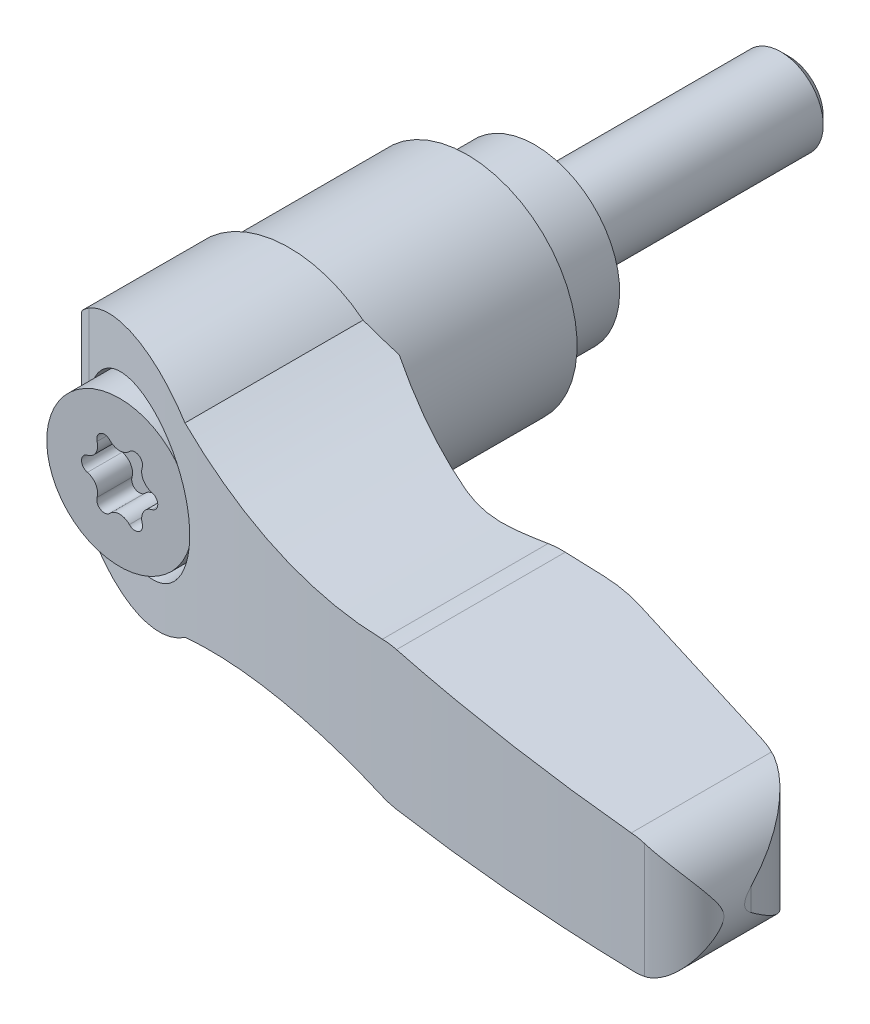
ISO-10303-21;
HEADER;
FILE_DESCRIPTION(('STEP AP214'),'2;1');
FILE_NAME('part.step','',(''),(''),'','','');
FILE_SCHEMA(('AUTOMOTIVE_DESIGN { 1 0 10303 214 1 1 1 1 }'));
ENDSEC;
DATA;
#1=APPLICATION_CONTEXT('core data for automotive mechanical design processes');
#2=APPLICATION_PROTOCOL_DEFINITION('international standard','automotive_design',2000,#1);
#3=PRODUCT_CONTEXT('',#1,'mechanical');
#4=PRODUCT('Part','Part','',(#3));
#5=PRODUCT_RELATED_PRODUCT_CATEGORY('part','',(#4));
#6=PRODUCT_DEFINITION_FORMATION('','',#4);
#7=PRODUCT_DEFINITION_CONTEXT('part definition',#1,'design');
#8=PRODUCT_DEFINITION('design','',#6,#7);
#9=PRODUCT_DEFINITION_SHAPE('','',#8);
#10=(LENGTH_UNIT() NAMED_UNIT(*) SI_UNIT(.MILLI.,.METRE.));
#11=(NAMED_UNIT(*) PLANE_ANGLE_UNIT() SI_UNIT($,.RADIAN.));
#12=(NAMED_UNIT(*) SI_UNIT($,.STERADIAN.) SOLID_ANGLE_UNIT());
#13=UNCERTAINTY_MEASURE_WITH_UNIT(LENGTH_MEASURE(1.E-05),#10,'distance_accuracy_value','');
#14=(GEOMETRIC_REPRESENTATION_CONTEXT(3) GLOBAL_UNCERTAINTY_ASSIGNED_CONTEXT((#13)) GLOBAL_UNIT_ASSIGNED_CONTEXT((#10,
#11,#12)) REPRESENTATION_CONTEXT('',''));
#15=CARTESIAN_POINT('',(0.,0.,0.));
#16=DIRECTION('',(0.,0.,1.));
#17=DIRECTION('',(1.,0.,0.));
#18=AXIS2_PLACEMENT_3D('',#15,#16,#17);
#19=CARTESIAN_POINT('',(0.,0.,-4.754266));
#20=DIRECTION('',(0.,0.,-1.));
#21=DIRECTION('',(0.,1.,0.));
#22=AXIS2_PLACEMENT_3D('',#19,#20,#21);
#23=CYLINDRICAL_SURFACE('',#22,2.5);
#24=CARTESIAN_POINT('',(0.,0.,-14.51));
#25=DIRECTION('',(0.,0.,-1.));
#26=DIRECTION('',(0.,1.,0.));
#27=AXIS2_PLACEMENT_3D('',#24,#25,#26);
#28=CIRCLE('',#27,2.5);
#29=CARTESIAN_POINT('',(0.,2.5,-14.51));
#30=VERTEX_POINT('',#29);
#31=EDGE_CURVE('E9',#30,#30,#28,.F.);
#32=ORIENTED_EDGE('',*,*,#31,.T.);
#33=EDGE_LOOP('',(#32));
#34=FACE_BOUND('',#33,.T.);
#35=CARTESIAN_POINT('',(0.,0.,0.));
#36=DIRECTION('',(0.,0.,-1.));
#37=DIRECTION('',(0.,1.,0.));
#38=AXIS2_PLACEMENT_3D('',#35,#36,#37);
#39=CIRCLE('',#38,2.5);
#40=CARTESIAN_POINT('',(0.,2.5,0.));
#41=VERTEX_POINT('',#40);
#42=EDGE_CURVE('E565',#41,#41,#39,.F.);
#43=ORIENTED_EDGE('',*,*,#42,.F.);
#44=EDGE_LOOP('',(#43));
#45=FACE_BOUND('',#44,.T.);
#46=ADVANCED_FACE('F14',(#34,#45),#23,.T.);
#47=CARTESIAN_POINT('',(3.75,0.,0.));
#48=DIRECTION('',(0.,0.,-1.));
#49=DIRECTION('',(0.,1.,0.));
#50=AXIS2_PLACEMENT_3D('',#47,#48,#49);
#51=PLANE('',#50);
#52=ORIENTED_EDGE('',*,*,#42,.T.);
#53=EDGE_LOOP('',(#52));
#54=FACE_BOUND('',#53,.T.);
#55=CARTESIAN_POINT('',(0.,0.,0.));
#56=DIRECTION('',(0.,0.,-1.));
#57=DIRECTION('',(0.,1.,0.));
#58=AXIS2_PLACEMENT_3D('',#55,#56,#57);
#59=CIRCLE('',#58,5.);
#60=CARTESIAN_POINT('',(0.,5.,0.));
#61=VERTEX_POINT('',#60);
#62=EDGE_CURVE('E725',#61,#61,#59,.F.);
#63=ORIENTED_EDGE('',*,*,#62,.F.);
#64=EDGE_LOOP('',(#63));
#65=FACE_BOUND('',#64,.T.);
#66=ADVANCED_FACE('F668',(#54,#65),#51,.T.);
#67=CARTESIAN_POINT('',(0.,0.,6.4));
#68=DIRECTION('',(0.,0.,-1.));
#69=DIRECTION('',(0.,1.,0.));
#70=AXIS2_PLACEMENT_3D('',#67,#68,#69);
#71=CYLINDRICAL_SURFACE('',#70,5.);
#72=ORIENTED_EDGE('',*,*,#62,.T.);
#73=EDGE_LOOP('',(#72));
#74=FACE_BOUND('',#73,.T.);
#75=CARTESIAN_POINT('',(0.,0.,4.55000000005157));
#76=DIRECTION('',(0.,0.,-1.));
#77=DIRECTION('',(1.,0.,0.));
#78=AXIS2_PLACEMENT_3D('',#75,#76,#77);
#79=CIRCLE('',#78,4.99999999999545);
#80=CARTESIAN_POINT('',(4.99999999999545,0.,4.55000000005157));
#81=VERTEX_POINT('',#80);
#82=EDGE_CURVE('E558',#81,#81,#79,.T.);
#83=ORIENTED_EDGE('',*,*,#82,.T.);
#84=EDGE_LOOP('',(#83));
#85=FACE_BOUND('',#84,.T.);
#86=ADVANCED_FACE('F675',(#74,#85),#71,.T.);
#87=CARTESIAN_POINT('',(0.,0.,4.30000000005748));
#88=DIRECTION('',(0.,0.,-1.));
#89=DIRECTION('',(0.,1.,0.));
#90=AXIS2_PLACEMENT_3D('',#87,#88,#89);
#91=CONICAL_SURFACE('',#90,5.24999999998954,0.785398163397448);
#92=ORIENTED_EDGE('',*,*,#82,.F.);
#93=EDGE_LOOP('',(#92));
#94=FACE_BOUND('',#93,.T.);
#95=CARTESIAN_POINT('',(0.,0.,4.3));
#96=DIRECTION('',(0.,0.,-1.));
#97=DIRECTION('',(0.,1.,0.));
#98=AXIS2_PLACEMENT_3D('',#95,#96,#97);
#99=CIRCLE('',#98,5.25);
#100=CARTESIAN_POINT('',(0.,5.25,4.3));
#101=VERTEX_POINT('',#100);
#102=EDGE_CURVE('E554',#101,#101,#99,.T.);
#103=ORIENTED_EDGE('',*,*,#102,.T.);
#104=EDGE_LOOP('',(#103));
#105=FACE_BOUND('',#104,.T.);
#106=ADVANCED_FACE('F683',(#94,#105),#91,.F.);
#107=CARTESIAN_POINT('',(0.,0.,3.65));
#108=DIRECTION('',(0.,0.,-1.));
#109=DIRECTION('',(0.,1.,0.));
#110=AXIS2_PLACEMENT_3D('',#107,#108,#109);
#111=CYLINDRICAL_SURFACE('',#110,5.25);
#112=ORIENTED_EDGE('',*,*,#102,.F.);
#113=EDGE_LOOP('',(#112));
#114=FACE_BOUND('',#113,.T.);
#115=CARTESIAN_POINT('',(0.,0.,4.));
#116=DIRECTION('',(0.,0.,-1.));
#117=DIRECTION('',(0.,1.,0.));
#118=AXIS2_PLACEMENT_3D('',#115,#116,#117);
#119=CIRCLE('',#118,5.25);
#120=CARTESIAN_POINT('',(0.,5.25,4.));
#121=VERTEX_POINT('',#120);
#122=EDGE_CURVE('E713',#121,#121,#119,.F.);
#123=ORIENTED_EDGE('',*,*,#122,.F.);
#124=EDGE_LOOP('',(#123));
#125=FACE_BOUND('',#124,.T.);
#126=ADVANCED_FACE('F690',(#114,#125),#111,.F.);
#127=CARTESIAN_POINT('',(-6.36002265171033,-14.,4.));
#128=DIRECTION('',(0.707106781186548,0.,0.707106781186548));
#129=DIRECTION('',(-0.707106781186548,0.,0.707106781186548));
#130=AXIS2_PLACEMENT_3D('',#127,#128,#129);
#131=PLANE('',#130);
#132=DIRECTION('',(0.,1.,0.));
#133=VECTOR('',#132,1.);
#134=CARTESIAN_POINT('',(-6.36002265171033,0.,4.));
#135=LINE('',#134,#133);
#136=CARTESIAN_POINT('',(-6.36002265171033,-1.38824072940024,4.));
#137=VERTEX_POINT('',#136);
#138=CARTESIAN_POINT('',(-6.36002265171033,1.38824072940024,4.));
#139=VERTEX_POINT('',#138);
#140=EDGE_CURVE('E715',#137,#139,#135,.T.);
#141=ORIENTED_EDGE('',*,*,#140,.F.);
#142=CARTESIAN_POINT('',(-0.0100000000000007,0.,-2.35002265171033));
#143=DIRECTION('',(0.707106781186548,0.,0.707106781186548));
#144=DIRECTION('',(-0.707106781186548,0.,0.707106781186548));
#145=AXIS2_PLACEMENT_3D('',#142,#143,#144);
#146=ELLIPSE('',#145,9.19238815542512,6.5);
#147=EDGE_CURVE('E557',#139,#137,#146,.T.);
#148=ORIENTED_EDGE('',*,*,#147,.F.);
#149=EDGE_LOOP('',(#141,#148));
#150=FACE_BOUND('',#149,.T.);
#151=ADVANCED_FACE('F694',(#150),#131,.F.);
#152=CARTESIAN_POINT('',(-3.26,0.,4.));
#153=DIRECTION('',(0.,0.,-1.));
#154=DIRECTION('',(0.,1.,0.));
#155=AXIS2_PLACEMENT_3D('',#152,#153,#154);
#156=PLANE('',#155);
#157=CARTESIAN_POINT('',(-0.00999999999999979,0.,4.));
#158=DIRECTION('',(0.,0.,1.));
#159=DIRECTION('',(-1.,0.,0.));
#160=AXIS2_PLACEMENT_3D('',#157,#158,#159);
#161=CIRCLE('',#160,6.5);
#162=EDGE_CURVE('E709',#137,#139,#161,.T.);
#163=ORIENTED_EDGE('',*,*,#162,.F.);
#164=ORIENTED_EDGE('',*,*,#140,.T.);
#165=EDGE_LOOP('',(#163,#164));
#166=FACE_BOUND('',#165,.T.);
#167=ORIENTED_EDGE('',*,*,#122,.T.);
#168=EDGE_LOOP('',(#167));
#169=FACE_BOUND('',#168,.T.);
#170=ADVANCED_FACE('F697',(#166,#169),#156,.T.);
#171=CARTESIAN_POINT('',(39.9389658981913,-8.,27.2042491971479));
#172=DIRECTION('',(0.989626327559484,0.,-0.143665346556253));
#173=DIRECTION('',(0.143665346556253,0.,0.989626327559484));
#174=AXIS2_PLACEMENT_3D('',#171,#172,#173);
#175=PLANE('',#174);
#176=CARTESIAN_POINT('',(36.5,0.,3.51522972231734));
#177=DIRECTION('',(0.989626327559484,0.,-0.143665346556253));
#178=DIRECTION('',(0.143665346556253,0.,0.989626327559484));
#179=AXIS2_PLACEMENT_3D('',#176,#177,#178);
#180=ELLIPSE('',#179,24.3621728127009,3.5);
#181=CARTESIAN_POINT('',(39.9389658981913,-0.650779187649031,27.2042491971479));
#182=VERTEX_POINT('',#181);
#183=CARTESIAN_POINT('',(39.9389658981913,0.650779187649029,27.2042491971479));
#184=VERTEX_POINT('',#183);
#185=EDGE_CURVE('E461',#182,#184,#180,.F.);
#186=ORIENTED_EDGE('',*,*,#185,.F.);
#187=DIRECTION('',(0.,-1.,0.));
#188=VECTOR('',#187,1.);
#189=CARTESIAN_POINT('',(39.9389658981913,-8.,27.2042491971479));
#190=LINE('',#189,#188);
#191=EDGE_CURVE('E848',#184,#182,#190,.T.);
#192=ORIENTED_EDGE('',*,*,#191,.F.);
#193=EDGE_LOOP('',(#186,#192));
#194=FACE_BOUND('',#193,.T.);
#195=ADVANCED_FACE('F485',(#194),#175,.T.);
#196=CARTESIAN_POINT('',(33.8626602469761,-8.,28.0863544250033));
#197=DIRECTION('',(0.,-1.,0.));
#198=DIRECTION('',(1.,0.,0.));
#199=AXIS2_PLACEMENT_3D('',#196,#197,#198);
#200=CYLINDRICAL_SURFACE('',#199,6.14);
#201=ORIENTED_EDGE('',*,*,#191,.T.);
#202=CARTESIAN_POINT('',(36.5,-3.5,22.5416236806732));
#203=CARTESIAN_POINT('',(36.6061539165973,-3.50000941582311,22.5920863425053));
#204=CARTESIAN_POINT('',(36.7107657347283,-3.49517280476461,22.6456099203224));
#205=CARTESIAN_POINT('',(36.9160027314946,-3.47671082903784,22.758101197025));
#206=CARTESIAN_POINT('',(37.0166343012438,-3.46310021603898,22.8170596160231));
#207=CARTESIAN_POINT('',(37.2123479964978,-3.42816986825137,22.9392782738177));
#208=CARTESIAN_POINT('',(37.3074768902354,-3.40693163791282,23.002487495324));
#209=CARTESIAN_POINT('',(37.4929223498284,-3.3575759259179,23.13320682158));
#210=CARTESIAN_POINT('',(37.5832363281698,-3.32945478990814,23.2007191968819));
#211=CARTESIAN_POINT('',(37.7830795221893,-3.25850520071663,23.358740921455));
#212=CARTESIAN_POINT('',(37.8909927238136,-3.21376078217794,23.4504360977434));
#213=CARTESIAN_POINT('',(38.0982482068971,-3.11588681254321,23.6389903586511));
#214=CARTESIAN_POINT('',(38.1975840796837,-3.06275107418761,23.7358532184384));
#215=CARTESIAN_POINT('',(38.3880468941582,-2.94917464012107,23.9343090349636));
#216=CARTESIAN_POINT('',(38.4791322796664,-2.88870020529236,24.0359224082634));
#217=CARTESIAN_POINT('',(38.6526412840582,-2.76182607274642,24.2426721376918));
#218=CARTESIAN_POINT('',(38.7350674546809,-2.69542813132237,24.3478074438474));
#219=CARTESIAN_POINT('',(38.9229341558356,-2.52996933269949,24.6038856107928));
#220=CARTESIAN_POINT('',(39.0243159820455,-2.42850340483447,24.7562617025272));
#221=CARTESIAN_POINT('',(39.2111706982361,-2.21796613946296,25.0654781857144));
#222=CARTESIAN_POINT('',(39.2966363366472,-2.10889136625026,25.2223205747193));
#223=CARTESIAN_POINT('',(39.452222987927,-1.88493092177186,25.5392893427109));
#224=CARTESIAN_POINT('',(39.5223498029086,-1.77004746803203,25.699414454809));
#225=CARTESIAN_POINT('',(39.6478320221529,-1.53583460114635,26.0220530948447));
#226=CARTESIAN_POINT('',(39.7031929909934,-1.41650688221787,26.1845656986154));
#227=CARTESIAN_POINT('',(39.7933776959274,-1.1901857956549,26.4900634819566));
#228=CARTESIAN_POINT('',(39.8299343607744,-1.08360162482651,26.6328455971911));
#229=CARTESIAN_POINT('',(39.8923391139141,-0.86858691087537,26.918504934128));
#230=CARTESIAN_POINT('',(39.918226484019,-0.76016469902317,27.0613798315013));
#231=CARTESIAN_POINT('',(39.9389658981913,-0.650779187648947,27.204249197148));
#232=B_SPLINE_CURVE_WITH_KNOTS('',3,(#202,#203,#204,#205,#206,#207,#208,#209,#210,#211,#212,
#213,#214,#215,#216,#217,#218,#219,#220,#221,#222,#223,#224,#225,#226,#227,#228,#229,#230,#231),
.UNSPECIFIED.,.F.,.F.,(4,2,2,2,2,2,2,2,2,2,2,2,2,2,4),(0.,0.352350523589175,0.704110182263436,
1.05221781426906,1.40051067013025,1.84538152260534,2.29058194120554,2.73791274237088,
3.18511134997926,3.81198117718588,4.43913591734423,5.06605301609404,5.69273352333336,
6.23807905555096,6.78139842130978),.UNSPECIFIED.);
#233=CARTESIAN_POINT('',(36.5,-3.5,22.5416236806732));
#234=VERTEX_POINT('',#233);
#235=EDGE_CURVE('E465',#234,#182,#232,.T.);
#236=ORIENTED_EDGE('',*,*,#235,.F.);
#237=CARTESIAN_POINT('',(33.8626602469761,-3.59762871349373,28.0863544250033));
#238=DIRECTION('',(-0.0369925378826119,0.999315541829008,0.));
#239=DIRECTION('',(-0.999315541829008,-0.0369925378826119,0.));
#240=AXIS2_PLACEMENT_3D('',#237,#238,#239);
#241=ELLIPSE('',#240,6.14420545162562,6.14);
#242=CARTESIAN_POINT('',(35.5344609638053,-3.53574220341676,22.1783359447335));
#243=VERTEX_POINT('',#242);
#244=EDGE_CURVE('E717',#234,#243,#241,.T.);
#245=ORIENTED_EDGE('',*,*,#244,.T.);
#246=DIRECTION('',(0.,-1.,0.));
#247=VECTOR('',#246,1.);
#248=CARTESIAN_POINT('',(35.5344609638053,-8.,22.1783359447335));
#249=LINE('',#248,#247);
#250=CARTESIAN_POINT('',(35.5344609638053,3.53574220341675,22.1783359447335));
#251=VERTEX_POINT('',#250);
#252=EDGE_CURVE('E539',#251,#243,#249,.T.);
#253=ORIENTED_EDGE('',*,*,#252,.F.);
#254=CARTESIAN_POINT('',(33.8626602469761,3.59762871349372,28.0863544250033));
#255=DIRECTION('',(-0.036992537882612,-0.999315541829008,0.));
#256=DIRECTION('',(0.999315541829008,-0.036992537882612,0.));
#257=AXIS2_PLACEMENT_3D('',#254,#255,#256);
#258=ELLIPSE('',#257,6.14420545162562,6.14);
#259=CARTESIAN_POINT('',(36.5,3.5,22.5416236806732));
#260=VERTEX_POINT('',#259);
#261=EDGE_CURVE('E847',#251,#260,#258,.T.);
#262=ORIENTED_EDGE('',*,*,#261,.T.);
#263=CARTESIAN_POINT('',(39.9389658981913,0.65077918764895,27.204249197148));
#264=CARTESIAN_POINT('',(39.9247028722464,0.726086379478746,27.1059853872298));
#265=CARTESIAN_POINT('',(39.9079968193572,0.800887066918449,27.0076860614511));
#266=CARTESIAN_POINT('',(39.8696347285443,0.949458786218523,26.8112602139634));
#267=CARTESIAN_POINT('',(39.8479781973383,1.02322971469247,26.7131337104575));
#268=CARTESIAN_POINT('',(39.7995979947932,1.169880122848,26.5170899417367));
#269=CARTESIAN_POINT('',(39.7728626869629,1.24275713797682,26.4191736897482));
#270=CARTESIAN_POINT('',(39.7142815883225,1.38725410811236,26.2239599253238));
#271=CARTESIAN_POINT('',(39.6824358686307,1.4588740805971,26.1266624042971));
#272=CARTESIAN_POINT('',(39.5782917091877,1.67318502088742,25.8337016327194));
#273=CARTESIAN_POINT('',(39.4979263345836,1.81366367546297,25.6391889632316));
#274=CARTESIAN_POINT('',(39.3150854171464,2.08619457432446,25.2551202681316));
#275=CARTESIAN_POINT('',(39.2126344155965,2.218255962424,25.0655590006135));
#276=CARTESIAN_POINT('',(38.9595027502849,2.49877334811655,24.6523338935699));
#277=CARTESIAN_POINT('',(38.8031801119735,2.64456339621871,24.4302018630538));
#278=CARTESIAN_POINT('',(38.5417124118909,2.84488994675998,24.1082756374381));
#279=CARTESIAN_POINT('',(38.4501831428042,2.90854134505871,24.0029632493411));
#280=CARTESIAN_POINT('',(38.2579442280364,3.02861213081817,23.7967186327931));
#281=CARTESIAN_POINT('',(38.1572360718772,3.08503268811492,23.6957856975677));
#282=CARTESIAN_POINT('',(37.8892625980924,3.21757634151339,23.4457323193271));
#283=CARTESIAN_POINT('',(37.7155213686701,3.28779061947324,23.3001643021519));
#284=CARTESIAN_POINT('',(37.4396992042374,3.37286339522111,23.0946053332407));
#285=CARTESIAN_POINT('',(37.3453175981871,3.39783246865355,23.0282732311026));
#286=CARTESIAN_POINT('',(37.1517842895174,3.44019984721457,22.9003457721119));
#287=CARTESIAN_POINT('',(37.0526354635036,3.45760265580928,22.8387476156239));
#288=CARTESIAN_POINT('',(36.8781783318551,3.48029211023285,22.7372021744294));
#289=CARTESIAN_POINT('',(36.8038676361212,3.48759914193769,22.6959814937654));
#290=CARTESIAN_POINT('',(36.6533047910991,3.497455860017,22.6165121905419));
#291=CARTESIAN_POINT('',(36.5770513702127,3.50000234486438,22.5782655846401));
#292=CARTESIAN_POINT('',(36.5,3.5,22.5416236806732));
#293=B_SPLINE_CURVE_WITH_KNOTS('',3,(#263,#264,#265,#266,#267,#268,#269,#270,#271,#272,#273,
#274,#275,#276,#277,#278,#279,#280,#281,#282,#283,#284,#285,#286,#287,#288,#289,#290,#291,#292),
.UNSPECIFIED.,.F.,.F.,(4,2,2,2,2,2,2,2,2,2,2,2,2,2,4),(0.,0.373839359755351,0.747715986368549,
1.12245980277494,1.49719840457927,2.25512351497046,3.01221072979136,3.93367725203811,
4.39332639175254,4.85290107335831,5.56171222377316,5.91546495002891,6.26900683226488,
6.52468766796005,6.78054039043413),.UNSPECIFIED.);
#294=EDGE_CURVE('E434',#184,#260,#293,.T.);
#295=ORIENTED_EDGE('',*,*,#294,.F.);
#296=EDGE_LOOP('',(#201,#236,#245,#253,#262,#295));
#297=FACE_BOUND('',#296,.T.);
#298=ADVANCED_FACE('F479',(#297),#200,.T.);
#299=CARTESIAN_POINT('',(-0.0099999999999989,0.,10.28125));
#300=DIRECTION('',(0.,0.,1.));
#301=DIRECTION('',(-1.,0.,0.));
#302=AXIS2_PLACEMENT_3D('',#299,#300,#301);
#303=CYLINDRICAL_SURFACE('',#302,6.5);
#304=CARTESIAN_POINT('',(-0.00999999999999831,0.,14.5));
#305=DIRECTION('',(0.,0.,1.));
#306=DIRECTION('',(-1.,0.,0.));
#307=AXIS2_PLACEMENT_3D('',#304,#305,#306);
#308=CIRCLE('',#307,6.5);
#309=CARTESIAN_POINT('',(-6.51,0.,14.5));
#310=VERTEX_POINT('',#309);
#311=CARTESIAN_POINT('',(6.49,0.,14.5));
#312=VERTEX_POINT('',#311);
#313=EDGE_CURVE('E850',#310,#312,#308,.T.);
#314=ORIENTED_EDGE('',*,*,#313,.F.);
#315=CARTESIAN_POINT('',(-0.00999999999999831,0.,14.5));
#316=DIRECTION('',(0.,0.,1.));
#317=DIRECTION('',(-1.,0.,0.));
#318=AXIS2_PLACEMENT_3D('',#315,#316,#317);
#319=CIRCLE('',#318,6.5);
#320=EDGE_CURVE('E536',#312,#310,#319,.T.);
#321=ORIENTED_EDGE('',*,*,#320,.F.);
#322=EDGE_LOOP('',(#314,#321));
#323=FACE_BOUND('',#322,.T.);
#324=ORIENTED_EDGE('',*,*,#162,.T.);
#325=ORIENTED_EDGE('',*,*,#147,.T.);
#326=EDGE_LOOP('',(#324,#325));
#327=FACE_BOUND('',#326,.T.);
#328=ADVANCED_FACE('F484',(#323,#327),#303,.T.);
#329=CARTESIAN_POINT('',(-6.51,-8.,14.5));
#330=DIRECTION('',(0.,0.,-1.));
#331=DIRECTION('',(0.,1.,0.));
#332=AXIS2_PLACEMENT_3D('',#329,#330,#331);
#333=PLANE('',#332);
#334=ORIENTED_EDGE('',*,*,#313,.T.);
#335=DIRECTION('',(0.,-1.,0.));
#336=VECTOR('',#335,1.);
#337=CARTESIAN_POINT('',(6.49,-8.,14.5));
#338=LINE('',#337,#336);
#339=CARTESIAN_POINT('',(6.49,-4.77390244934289,14.5));
#340=VERTEX_POINT('',#339);
#341=EDGE_CURVE('E853',#312,#340,#338,.T.);
#342=ORIENTED_EDGE('',*,*,#341,.T.);
#343=CARTESIAN_POINT('',(14.8,-33.6,14.5));
#344=DIRECTION('',(0.,0.,1.));
#345=DIRECTION('',(0.,-1.,0.));
#346=AXIS2_PLACEMENT_3D('',#343,#344,#345);
#347=CIRCLE('',#346,30.);
#348=CARTESIAN_POINT('',(4.36278582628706,-5.47413005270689,14.5));
#349=VERTEX_POINT('',#348);
#350=EDGE_CURVE('E810',#340,#349,#347,.T.);
#351=ORIENTED_EDGE('',*,*,#350,.T.);
#352=CARTESIAN_POINT('',(0.,0.,14.5));
#353=DIRECTION('',(0.,0.,1.));
#354=DIRECTION('',(0.,-1.,0.));
#355=AXIS2_PLACEMENT_3D('',#352,#353,#354);
#356=CIRCLE('',#355,7.);
#357=CARTESIAN_POINT('',(-6.51,-2.57291663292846,14.5));
#358=VERTEX_POINT('',#357);
#359=EDGE_CURVE('E372',#358,#349,#356,.T.);
#360=ORIENTED_EDGE('',*,*,#359,.F.);
#361=DIRECTION('',(0.,-1.,0.));
#362=VECTOR('',#361,1.);
#363=CARTESIAN_POINT('',(-6.51,-8.,14.5));
#364=LINE('',#363,#362);
#365=EDGE_CURVE('E535',#310,#358,#364,.T.);
#366=ORIENTED_EDGE('',*,*,#365,.F.);
#367=EDGE_LOOP('',(#334,#342,#351,#360,#366));
#368=FACE_BOUND('',#367,.T.);
#369=ADVANCED_FACE('F490',(#368),#333,.T.);
#370=CARTESIAN_POINT('',(20.6060580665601,0.915064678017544,31.));
#371=DIRECTION('',(0.,0.,1.));
#372=DIRECTION('',(0.,-1.,0.));
#373=AXIS2_PLACEMENT_3D('',#370,#371,#372);
#374=CYLINDRICAL_SURFACE('',#373,5.);
#375=CARTESIAN_POINT('',(20.7910207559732,-4.08151303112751,28.9575923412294));
#376=CARTESIAN_POINT('',(20.6207575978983,-4.08776311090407,28.9275070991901));
#377=CARTESIAN_POINT('',(20.4510927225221,-4.08540030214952,28.8972050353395));
#378=CARTESIAN_POINT('',(20.1129595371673,-4.06344890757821,28.8361672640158));
#379=CARTESIAN_POINT('',(19.9444912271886,-4.04386032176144,28.8054315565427));
#380=CARTESIAN_POINT('',(19.7766211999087,-4.01565884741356,28.7744790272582));
#381=B_SPLINE_CURVE_WITH_KNOTS('',3,(#375,#376,#377,#378,#379,#380),.UNSPECIFIED.,.F.,.F.,(4,2,
4),(0.,0.517097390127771,1.03419478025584),.UNSPECIFIED.);
#382=CARTESIAN_POINT('',(20.7910207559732,-4.08151303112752,28.9575923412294));
#383=VERTEX_POINT('',#382);
#384=CARTESIAN_POINT('',(19.7766211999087,-4.01565884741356,28.7744790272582));
#385=VERTEX_POINT('',#384);
#386=EDGE_CURVE('E468',#383,#385,#381,.T.);
#387=ORIENTED_EDGE('',*,*,#386,.T.);
#388=DIRECTION('',(0.,0.,1.));
#389=VECTOR('',#388,1.);
#390=CARTESIAN_POINT('',(19.7766211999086,-4.01565884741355,31.));
#391=LINE('',#390,#389);
#392=CARTESIAN_POINT('',(19.7766211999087,-4.01565884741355,19.));
#393=VERTEX_POINT('',#392);
#394=EDGE_CURVE('E803',#385,#393,#391,.F.);
#395=ORIENTED_EDGE('',*,*,#394,.T.);
#396=CARTESIAN_POINT('',(20.6060580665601,0.915064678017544,19.));
#397=DIRECTION('',(0.,0.,1.));
#398=DIRECTION('',(0.,-1.,0.));
#399=AXIS2_PLACEMENT_3D('',#396,#397,#398);
#400=CIRCLE('',#399,5.);
#401=CARTESIAN_POINT('',(20.7910207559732,-4.08151303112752,19.));
#402=VERTEX_POINT('',#401);
#403=EDGE_CURVE('E857',#402,#393,#400,.F.);
#404=ORIENTED_EDGE('',*,*,#403,.F.);
#405=DIRECTION('',(0.,0.,1.));
#406=VECTOR('',#405,1.);
#407=CARTESIAN_POINT('',(20.7910207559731,-4.08151303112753,31.));
#408=LINE('',#407,#406);
#409=EDGE_CURVE('E809',#402,#383,#408,.T.);
#410=ORIENTED_EDGE('',*,*,#409,.T.);
#411=EDGE_LOOP('',(#387,#395,#404,#410));
#412=FACE_BOUND('',#411,.T.);
#413=ADVANCED_FACE('F426',(#412),#374,.T.);
#414=CARTESIAN_POINT('',(36.5,0.,31.));
#415=DIRECTION('',(0.,0.,1.));
#416=DIRECTION('',(0.,-1.,0.));
#417=AXIS2_PLACEMENT_3D('',#414,#415,#416);
#418=CYLINDRICAL_SURFACE('',#417,3.5);
#419=CARTESIAN_POINT('',(37.3240183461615,-3.40161634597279,30.8631619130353));
#420=CARTESIAN_POINT('',(37.188603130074,-3.43435641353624,30.8557619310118));
#421=CARTESIAN_POINT('',(37.0522273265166,-3.45892508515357,30.8481012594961));
#422=CARTESIAN_POINT('',(36.7775545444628,-3.49171963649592,30.8322585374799));
#423=CARTESIAN_POINT('',(36.6392575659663,-3.499945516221,30.8240764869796));
#424=CARTESIAN_POINT('',(36.5,-3.5,30.815633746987));
#425=B_SPLINE_CURVE_WITH_KNOTS('',3,(#419,#420,#421,#422,#423,#424),.UNSPECIFIED.,.F.,.F.,(4,2,
4),(0.,0.416348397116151,0.832696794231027),.UNSPECIFIED.);
#426=CARTESIAN_POINT('',(37.3240183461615,-3.40161634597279,30.8631619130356));
#427=VERTEX_POINT('',#426);
#428=CARTESIAN_POINT('',(36.5,-3.5,30.815633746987));
#429=VERTEX_POINT('',#428);
#430=EDGE_CURVE('E446',#427,#429,#425,.T.);
#431=ORIENTED_EDGE('',*,*,#430,.T.);
#432=DIRECTION('',(0.,0.,1.));
#433=VECTOR('',#432,1.);
#434=CARTESIAN_POINT('',(36.5,-3.5,31.));
#435=LINE('',#434,#433);
#436=EDGE_CURVE('E820',#429,#234,#435,.F.);
#437=ORIENTED_EDGE('',*,*,#436,.T.);
#438=ORIENTED_EDGE('',*,*,#235,.T.);
#439=ORIENTED_EDGE('',*,*,#185,.T.);
#440=ORIENTED_EDGE('',*,*,#294,.T.);
#441=DIRECTION('',(0.,0.,1.));
#442=VECTOR('',#441,1.);
#443=CARTESIAN_POINT('',(36.5,3.5,31.));
#444=LINE('',#443,#442);
#445=CARTESIAN_POINT('',(36.5,3.5,30.815633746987));
#446=VERTEX_POINT('',#445);
#447=EDGE_CURVE('E414',#260,#446,#444,.T.);
#448=ORIENTED_EDGE('',*,*,#447,.T.);
#449=CARTESIAN_POINT('',(36.5,3.5,30.815633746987));
#450=CARTESIAN_POINT('',(36.6392575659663,3.499945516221,30.8240764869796));
#451=CARTESIAN_POINT('',(36.7775545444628,3.49171963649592,30.8322585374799));
#452=CARTESIAN_POINT('',(37.0522273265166,3.45892508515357,30.8481012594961));
#453=CARTESIAN_POINT('',(37.188603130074,3.43435641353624,30.8557619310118));
#454=CARTESIAN_POINT('',(37.3240183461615,3.40161634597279,30.8631619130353));
#455=B_SPLINE_CURVE_WITH_KNOTS('',3,(#449,#450,#451,#452,#453,#454),.UNSPECIFIED.,.F.,.F.,(4,2,
4),(0.,0.416348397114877,0.832696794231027),.UNSPECIFIED.);
#456=CARTESIAN_POINT('',(37.3240183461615,3.40161634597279,30.8631619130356));
#457=VERTEX_POINT('',#456);
#458=EDGE_CURVE('E452',#446,#457,#455,.T.);
#459=ORIENTED_EDGE('',*,*,#458,.T.);
#460=CARTESIAN_POINT('',(37.3240183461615,-3.40161634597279,30.8631619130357));
#461=CARTESIAN_POINT('',(37.391971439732,-3.38517327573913,30.8668921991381));
#462=CARTESIAN_POINT('',(37.4595366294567,-3.36663320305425,30.8678982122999));
#463=CARTESIAN_POINT('',(37.5932555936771,-3.32560440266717,30.8647814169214));
#464=CARTESIAN_POINT('',(37.6594109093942,-3.30312026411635,30.8606645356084));
#465=CARTESIAN_POINT('',(37.7892420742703,-3.25463078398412,30.8476880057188));
#466=CARTESIAN_POINT('',(37.8529349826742,-3.22865926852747,30.8388717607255));
#467=CARTESIAN_POINT('',(37.9780608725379,-3.17332967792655,30.8169101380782));
#468=CARTESIAN_POINT('',(38.0394932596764,-3.14397072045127,30.8037636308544));
#469=CARTESIAN_POINT('',(38.2193405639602,-3.05154774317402,30.7585650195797));
#470=CARTESIAN_POINT('',(38.3339861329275,-2.98387991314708,30.7206782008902));
#471=CARTESIAN_POINT('',(38.5517467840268,-2.83858348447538,30.6324207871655));
#472=CARTESIAN_POINT('',(38.6548343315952,-2.76093200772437,30.5820212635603));
#473=CARTESIAN_POINT('',(38.8266237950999,-2.61655584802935,30.4842690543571));
#474=CARTESIAN_POINT('',(38.8977926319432,-2.55140368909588,30.4388637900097));
#475=CARTESIAN_POINT('',(39.0330318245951,-2.41719472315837,30.3433991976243));
#476=CARTESIAN_POINT('',(39.0970985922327,-2.34813596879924,30.2933375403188));
#477=CARTESIAN_POINT('',(39.2184581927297,-2.20651617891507,30.1893556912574));
#478=CARTESIAN_POINT('',(39.2757265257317,-2.13394372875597,30.1354226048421));
#479=CARTESIAN_POINT('',(39.3834200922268,-1.9860149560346,30.0247265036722));
#480=CARTESIAN_POINT('',(39.4338475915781,-1.91065956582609,29.9679644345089));
#481=CARTESIAN_POINT('',(39.542421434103,-1.73419420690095,29.8348143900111));
#482=CARTESIAN_POINT('',(39.598263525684,-1.63221056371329,29.7576996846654));
#483=CARTESIAN_POINT('',(39.699250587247,-1.42414609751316,29.601672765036));
#484=CARTESIAN_POINT('',(39.7443776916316,-1.31805876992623,29.5227577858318));
#485=CARTESIAN_POINT('',(39.8239747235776,-1.10201279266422,29.3659397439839));
#486=CARTESIAN_POINT('',(39.8584944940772,-0.992075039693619,29.2880336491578));
#487=CARTESIAN_POINT('',(39.9024720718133,-0.82253324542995,29.1754655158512));
#488=CARTESIAN_POINT('',(39.9158188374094,-0.765322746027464,29.13870216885));
#489=CARTESIAN_POINT('',(39.9398686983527,-0.648731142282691,29.0678855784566));
#490=CARTESIAN_POINT('',(39.9505741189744,-0.589352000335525,29.0338299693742));
#491=CARTESIAN_POINT('',(39.9677206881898,-0.477086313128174,28.9756719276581));
#492=CARTESIAN_POINT('',(39.974567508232,-0.424644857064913,28.9508463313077));
#493=CARTESIAN_POINT('',(39.9860225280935,-0.317100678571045,28.907341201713));
#494=CARTESIAN_POINT('',(39.9906385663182,-0.262008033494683,28.8886402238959));
#495=CARTESIAN_POINT('',(39.9966232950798,-0.160247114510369,28.8637621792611));
#496=CARTESIAN_POINT('',(39.9984523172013,-0.114054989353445,28.8558445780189));
#497=CARTESIAN_POINT('',(40.0002450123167,-0.0209847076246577,28.8480882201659));
#498=CARTESIAN_POINT('',(40.0002117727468,0.0258921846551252,28.8482360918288));
#499=CARTESIAN_POINT('',(39.9982952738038,0.118672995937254,28.8565205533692));
#500=CARTESIAN_POINT('',(39.9964185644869,0.164579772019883,28.8646288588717));
#501=CARTESIAN_POINT('',(39.9910078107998,0.254792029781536,28.8870889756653));
#502=CARTESIAN_POINT('',(39.9874686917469,0.299092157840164,28.9014598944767));
#503=CARTESIAN_POINT('',(39.9768286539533,0.407331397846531,28.9425912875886));
#504=CARTESIAN_POINT('',(39.9688318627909,0.470155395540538,28.9719647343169));
#505=CARTESIAN_POINT('',(39.9499914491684,0.592804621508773,29.0357410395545));
#506=CARTESIAN_POINT('',(39.9391403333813,0.652621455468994,29.0701570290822));
#507=CARTESIAN_POINT('',(39.9146680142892,0.770512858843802,29.1419527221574));
#508=CARTESIAN_POINT('',(39.9010255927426,0.828569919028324,29.1793537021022));
#509=CARTESIAN_POINT('',(39.8711029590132,0.942947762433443,29.2555520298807));
#510=CARTESIAN_POINT('',(39.8548256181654,0.999270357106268,29.2943478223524));
#511=CARTESIAN_POINT('',(39.8016739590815,1.1674299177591,29.4125134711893));
#512=CARTESIAN_POINT('',(39.7607265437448,1.27728939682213,29.4929030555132));
#513=CARTESIAN_POINT('',(39.6677865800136,1.49294867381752,29.6529500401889));
#514=CARTESIAN_POINT('',(39.6157834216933,1.59874445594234,29.7326066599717));
#515=CARTESIAN_POINT('',(39.5005966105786,1.80564912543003,29.8886982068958));
#516=CARTESIAN_POINT('',(39.4374685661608,1.90677830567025,29.9651469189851));
#517=CARTESIAN_POINT('',(39.2994325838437,2.10420227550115,30.1133265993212));
#518=CARTESIAN_POINT('',(39.2245348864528,2.20050117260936,30.1850615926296));
#519=CARTESIAN_POINT('',(39.0442952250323,2.40820732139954,30.3372677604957));
#520=CARTESIAN_POINT('',(38.9358891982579,2.51819093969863,30.4161164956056));
#521=CARTESIAN_POINT('',(38.7000552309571,2.72661786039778,30.559662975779));
#522=CARTESIAN_POINT('',(38.5726400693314,2.82506883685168,30.6243701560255));
#523=CARTESIAN_POINT('',(38.3254291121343,2.98922527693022,30.7237895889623));
#524=CARTESIAN_POINT('',(38.2087731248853,3.05759969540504,30.7618633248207));
#525=CARTESIAN_POINT('',(37.9650872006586,3.18151973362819,30.8217517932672));
#526=CARTESIAN_POINT('',(37.8380870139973,3.23710049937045,30.8436114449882));
#527=CARTESIAN_POINT('',(37.6449762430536,3.3080955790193,30.8616374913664));
#528=CARTESIAN_POINT('',(37.5816159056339,3.32934954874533,30.8652564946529));
#529=CARTESIAN_POINT('',(37.4536360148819,3.36824327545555,30.867801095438));
#530=CARTESIAN_POINT('',(37.389015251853,3.38587935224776,30.8667219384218));
#531=CARTESIAN_POINT('',(37.3240183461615,3.40161634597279,30.8631619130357));
#532=B_SPLINE_CURVE_WITH_KNOTS('',3,(#460,#461,#462,#463,#464,#465,#466,#467,#468,#469,#470,
#471,#472,#473,#474,#475,#476,#477,#478,#479,#480,#481,#482,#483,#484,#485,#486,#487,#488,#489,
#490,#491,#492,#493,#494,#495,#496,#497,#498,#499,#500,#501,#502,#503,#504,#505,#506,#507,#508,
#509,#510,#511,#512,#513,#514,#515,#516,#517,#518,#519,#520,#521,#522,#523,#524,#525,#526,#527,
#528,#529,#530,#531),.UNSPECIFIED.,.F.,.F.,(4,2,2,2,2,2,2,2,2,2,2,2,2,2,2,2,2,2,2,2,2,2,2,2,2,2,
2,2,2,2,2,2,2,2,2,4),(0.,0.20991378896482,0.419584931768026,0.62735226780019,0.83517384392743,
1.2486492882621,1.66308971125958,1.98257890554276,2.30222878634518,2.62299771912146,
2.94366014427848,3.36167065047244,3.78037330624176,4.19707731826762,4.40489951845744,
4.61253810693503,4.78756393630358,4.9619702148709,5.10204921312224,5.24189598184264,
5.38124764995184,5.52102749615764,5.72989301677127,5.9393124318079,6.15038720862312,
6.36123350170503,6.7871576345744,7.21349237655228,7.63775356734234,8.06164764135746,
8.58013018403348,9.09826573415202,9.51811060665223,9.9367879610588,10.1373304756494,
10.3380759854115),.UNSPECIFIED.);
#533=EDGE_CURVE('E406',#427,#457,#532,.T.);
#534=ORIENTED_EDGE('',*,*,#533,.F.);
#535=EDGE_LOOP('',(#431,#437,#438,#439,#440,#448,#459,#534));
#536=FACE_BOUND('',#535,.T.);
#537=ADVANCED_FACE('F420',(#536),#418,.T.);
#538=CARTESIAN_POINT('',(23.0466685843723,-8.,28.05));
#539=DIRECTION('',(0.,-1.,0.));
#540=DIRECTION('',(1.,0.,0.));
#541=AXIS2_PLACEMENT_3D('',#538,#539,#540);
#542=CYLINDRICAL_SURFACE('',#541,9.05000000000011);
#543=CARTESIAN_POINT('',(23.0466685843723,3.99801374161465,28.05));
#544=DIRECTION('',(-0.036992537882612,-0.999315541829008,0.));
#545=DIRECTION('',(0.999315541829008,-0.036992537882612,0.));
#546=AXIS2_PLACEMENT_3D('',#543,#544,#545);
#547=ELLIPSE('',#546,9.05619858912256,9.05000000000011);
#548=CARTESIAN_POINT('',(23.0466685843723,3.99801374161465,19.));
#549=VERTEX_POINT('',#548);
#550=CARTESIAN_POINT('',(25.5108048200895,3.90679665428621,19.34192715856));
#551=VERTEX_POINT('',#550);
#552=EDGE_CURVE('E402',#549,#551,#547,.T.);
#553=ORIENTED_EDGE('',*,*,#552,.T.);
#554=DIRECTION('',(0.,-1.,0.));
#555=VECTOR('',#554,1.);
#556=CARTESIAN_POINT('',(25.5108048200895,-8.,19.34192715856));
#557=LINE('',#556,#555);
#558=CARTESIAN_POINT('',(25.5108048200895,-3.90679665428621,19.34192715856));
#559=VERTEX_POINT('',#558);
#560=EDGE_CURVE('E459',#559,#551,#557,.F.);
#561=ORIENTED_EDGE('',*,*,#560,.F.);
#562=CARTESIAN_POINT('',(23.0466685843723,-3.99801374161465,28.05));
#563=DIRECTION('',(-0.0369925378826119,0.999315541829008,0.));
#564=DIRECTION('',(-0.999315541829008,-0.0369925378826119,0.));
#565=AXIS2_PLACEMENT_3D('',#562,#563,#564);
#566=ELLIPSE('',#565,9.05619858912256,9.05000000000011);
#567=CARTESIAN_POINT('',(23.0466685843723,-3.99801374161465,19.));
#568=VERTEX_POINT('',#567);
#569=EDGE_CURVE('E416',#559,#568,#566,.T.);
#570=ORIENTED_EDGE('',*,*,#569,.T.);
#571=DIRECTION('',(0.,1.,0.));
#572=VECTOR('',#571,1.);
#573=CARTESIAN_POINT('',(23.0466685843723,-8.,19.));
#574=LINE('',#573,#572);
#575=EDGE_CURVE('E543',#549,#568,#574,.F.);
#576=ORIENTED_EDGE('',*,*,#575,.F.);
#577=EDGE_LOOP('',(#553,#561,#570,#576));
#578=FACE_BOUND('',#577,.T.);
#579=ADVANCED_FACE('F425',(#578),#542,.T.);
#580=CARTESIAN_POINT('',(25.5108048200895,-8.,19.34192715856));
#581=DIRECTION('',(0.272280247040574,0.,-0.962217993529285));
#582=DIRECTION('',(0.962217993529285,0.,0.272280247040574));
#583=AXIS2_PLACEMENT_3D('',#580,#581,#582);
#584=PLANE('',#583);
#585=DIRECTION('',(0.961608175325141,-0.0355966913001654,0.272107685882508));
#586=VECTOR('',#585,1.);
#587=CARTESIAN_POINT('',(25.5108048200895,3.90679665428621,19.34192715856));
#588=LINE('',#587,#586);
#589=EDGE_CURVE('E404',#551,#251,#588,.T.);
#590=ORIENTED_EDGE('',*,*,#589,.T.);
#591=ORIENTED_EDGE('',*,*,#252,.T.);
#592=DIRECTION('',(-0.961608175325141,-0.0355966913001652,-0.272107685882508));
#593=VECTOR('',#592,1.);
#594=CARTESIAN_POINT('',(35.5344609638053,-3.53574220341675,22.1783359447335));
#595=LINE('',#594,#593);
#596=EDGE_CURVE('E817',#243,#559,#595,.T.);
#597=ORIENTED_EDGE('',*,*,#596,.T.);
#598=ORIENTED_EDGE('',*,*,#560,.T.);
#599=EDGE_LOOP('',(#590,#591,#597,#598));
#600=FACE_BOUND('',#599,.T.);
#601=ADVANCED_FACE('F875',(#600),#584,.T.);
#602=CARTESIAN_POINT('',(20.60605806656,-0.915064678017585,31.));
#603=DIRECTION('',(0.,0.,1.));
#604=DIRECTION('',(0.,-1.,0.));
#605=AXIS2_PLACEMENT_3D('',#602,#603,#604);
#606=CYLINDRICAL_SURFACE('',#605,5.00000000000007);
#607=CARTESIAN_POINT('',(19.7766211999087,4.01565884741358,28.7744790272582));
#608=CARTESIAN_POINT('',(19.9444912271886,4.04386032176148,28.8054315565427));
#609=CARTESIAN_POINT('',(20.1129595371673,4.06344890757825,28.8361672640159));
#610=CARTESIAN_POINT('',(20.4510927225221,4.08540030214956,28.8972050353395));
#611=CARTESIAN_POINT('',(20.6207575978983,4.08776311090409,28.9275070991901));
#612=CARTESIAN_POINT('',(20.7910207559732,4.08151303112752,28.9575923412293));
#613=B_SPLINE_CURVE_WITH_KNOTS('',3,(#607,#608,#609,#610,#611,#612),.UNSPECIFIED.,.F.,.F.,(4,2,
4),(0.,0.517097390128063,1.03419478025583),.UNSPECIFIED.);
#614=CARTESIAN_POINT('',(19.7766211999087,4.01565884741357,28.7744790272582));
#615=VERTEX_POINT('',#614);
#616=CARTESIAN_POINT('',(20.7910207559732,4.08151303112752,28.9575923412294));
#617=VERTEX_POINT('',#616);
#618=EDGE_CURVE('E542',#615,#617,#613,.T.);
#619=ORIENTED_EDGE('',*,*,#618,.T.);
#620=DIRECTION('',(0.,0.,1.));
#621=VECTOR('',#620,1.);
#622=CARTESIAN_POINT('',(20.7910207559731,4.08151303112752,31.));
#623=LINE('',#622,#621);
#624=CARTESIAN_POINT('',(20.7910207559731,4.08151303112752,19.));
#625=VERTEX_POINT('',#624);
#626=EDGE_CURVE('E828',#617,#625,#623,.F.);
#627=ORIENTED_EDGE('',*,*,#626,.T.);
#628=CARTESIAN_POINT('',(20.60605806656,-0.915064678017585,19.));
#629=DIRECTION('',(0.,0.,1.));
#630=DIRECTION('',(0.,-1.,0.));
#631=AXIS2_PLACEMENT_3D('',#628,#629,#630);
#632=CIRCLE('',#631,5.00000000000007);
#633=CARTESIAN_POINT('',(19.7766211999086,4.01565884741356,19.));
#634=VERTEX_POINT('',#633);
#635=EDGE_CURVE('E547',#634,#625,#632,.F.);
#636=ORIENTED_EDGE('',*,*,#635,.F.);
#637=DIRECTION('',(0.,0.,1.));
#638=VECTOR('',#637,1.);
#639=CARTESIAN_POINT('',(19.7766211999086,4.01565884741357,31.));
#640=LINE('',#639,#638);
#641=EDGE_CURVE('E401',#634,#615,#640,.T.);
#642=ORIENTED_EDGE('',*,*,#641,.T.);
#643=EDGE_LOOP('',(#619,#627,#636,#642));
#644=FACE_BOUND('',#643,.T.);
#645=ADVANCED_FACE('F872',(#644),#606,.T.);
#646=CARTESIAN_POINT('',(42.8289340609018,-8.,-49.9630271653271));
#647=DIRECTION('',(0.,-1.,0.));
#648=DIRECTION('',(1.,0.,0.));
#649=AXIS2_PLACEMENT_3D('',#646,#647,#648);
#650=CYLINDRICAL_SURFACE('',#649,74.0000000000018);
#651=DIRECTION('',(0.,-1.,0.));
#652=VECTOR('',#651,1.);
#653=CARTESIAN_POINT('',(14.2560355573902,-8.,18.2981585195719));
#654=LINE('',#653,#652);
#655=CARTESIAN_POINT('',(14.2560355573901,3.60493202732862,18.2981585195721));
#656=VERTEX_POINT('',#655);
#657=CARTESIAN_POINT('',(14.2560355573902,-3.60493202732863,18.2981585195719));
#658=VERTEX_POINT('',#657);
#659=EDGE_CURVE('E855',#656,#658,#654,.T.);
#660=ORIENTED_EDGE('',*,*,#659,.T.);
#661=CARTESIAN_POINT('',(14.2560355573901,-3.60493202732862,18.2981585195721));
#662=CARTESIAN_POINT('',(13.91912090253,-3.61104217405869,18.1571345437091));
#663=CARTESIAN_POINT('',(13.5833701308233,-3.62280963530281,18.0136612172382));
#664=CARTESIAN_POINT('',(12.9145226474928,-3.65743626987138,17.7219861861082));
#665=CARTESIAN_POINT('',(12.5814258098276,-3.68029491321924,17.5737847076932));
#666=CARTESIAN_POINT('',(11.5893580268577,-3.7649360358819,17.1235938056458));
#667=CARTESIAN_POINT('',(10.9347595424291,-3.84283944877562,16.8148240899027));
#668=CARTESIAN_POINT('',(9.64003521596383,-4.03983028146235,16.1808788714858));
#669=CARTESIAN_POINT('',(8.99990836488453,-4.15891482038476,15.8557045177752));
#670=CARTESIAN_POINT('',(7.73340291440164,-4.43691869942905,15.1892512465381));
#671=CARTESIAN_POINT('',(7.10709183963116,-4.5960001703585,14.8479114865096));
#672=CARTESIAN_POINT('',(6.49,-4.77390244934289,14.5));
#673=B_SPLINE_CURVE_WITH_KNOTS('',3,(#661,#662,#663,#664,#665,#666,#667,#668,#669,#670,#671,
#672),.UNSPECIFIED.,.F.,.F.,(4,2,2,2,2,4),(0.,1.09575278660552,2.19145321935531,
4.37360080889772,6.55559577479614,8.74658240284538),.UNSPECIFIED.);
#674=EDGE_CURVE('E356',#658,#340,#673,.T.);
#675=ORIENTED_EDGE('',*,*,#674,.T.);
#676=ORIENTED_EDGE('',*,*,#341,.F.);
#677=DIRECTION('',(0.,1.,0.));
#678=VECTOR('',#677,1.);
#679=CARTESIAN_POINT('',(6.49,-8.,14.5));
#680=LINE('',#679,#678);
#681=CARTESIAN_POINT('',(6.49,4.77390244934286,14.5));
#682=VERTEX_POINT('',#681);
#683=EDGE_CURVE('E546',#682,#312,#680,.F.);
#684=ORIENTED_EDGE('',*,*,#683,.F.);
#685=CARTESIAN_POINT('',(6.49,4.77390244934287,14.5));
#686=CARTESIAN_POINT('',(7.10709183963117,4.59600017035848,14.8479114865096));
#687=CARTESIAN_POINT('',(7.73340291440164,4.43691869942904,15.1892512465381));
#688=CARTESIAN_POINT('',(8.99990836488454,4.15891482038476,15.8557045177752));
#689=CARTESIAN_POINT('',(9.64003521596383,4.03983028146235,16.1808788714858));
#690=CARTESIAN_POINT('',(10.9347595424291,3.84283944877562,16.8148240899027));
#691=CARTESIAN_POINT('',(11.5893580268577,3.7649360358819,17.1235938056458));
#692=CARTESIAN_POINT('',(12.5814258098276,3.68029491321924,17.5737847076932));
#693=CARTESIAN_POINT('',(12.9145226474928,3.65743626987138,17.7219861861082));
#694=CARTESIAN_POINT('',(13.5833701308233,3.62280963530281,18.0136612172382));
#695=CARTESIAN_POINT('',(13.91912090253,3.61104217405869,18.1571345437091));
#696=CARTESIAN_POINT('',(14.2560355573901,3.60493202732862,18.2981585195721));
#697=B_SPLINE_CURVE_WITH_KNOTS('',3,(#685,#686,#687,#688,#689,#690,#691,#692,#693,#694,#695,
#696),.UNSPECIFIED.,.F.,.F.,(4,2,2,2,2,4),(0.,2.19098662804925,4.37298159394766,
6.55512918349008,7.65082961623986,8.74658240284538),.UNSPECIFIED.);
#698=EDGE_CURVE('E392',#682,#656,#697,.T.);
#699=ORIENTED_EDGE('',*,*,#698,.T.);
#700=EDGE_LOOP('',(#660,#675,#676,#684,#699));
#701=FACE_BOUND('',#700,.T.);
#702=ADVANCED_FACE('F379',(#701),#650,.F.);
#703=CARTESIAN_POINT('',(17.7504238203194,-8.,9.95000000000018));
#704=DIRECTION('',(0.,-1.,0.));
#705=DIRECTION('',(1.,0.,0.));
#706=AXIS2_PLACEMENT_3D('',#703,#704,#705);
#707=CYLINDRICAL_SURFACE('',#706,9.04999999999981);
#708=ORIENTED_EDGE('',*,*,#659,.F.);
#709=CARTESIAN_POINT('',(14.2560355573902,3.60493202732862,18.2981585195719));
#710=CARTESIAN_POINT('',(14.483816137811,3.60077563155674,18.3935396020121));
#711=CARTESIAN_POINT('',(14.7155749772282,3.59919241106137,18.4795580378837));
#712=CARTESIAN_POINT('',(15.1854578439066,3.60156277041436,18.6324166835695));
#713=CARTESIAN_POINT('',(15.4235855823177,3.60551965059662,18.699245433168));
#714=CARTESIAN_POINT('',(15.9002362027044,3.61924836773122,18.8121846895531));
#715=CARTESIAN_POINT('',(16.1386829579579,3.62891979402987,18.8586293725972));
#716=CARTESIAN_POINT('',(16.6180975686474,3.65418161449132,18.9321530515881));
#717=CARTESIAN_POINT('',(16.8590635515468,3.66976787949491,18.9592455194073));
#718=CARTESIAN_POINT('',(17.2084780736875,3.69663888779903,18.9844088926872));
#719=CARTESIAN_POINT('',(17.3166030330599,3.70554405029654,18.9902441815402));
#720=CARTESIAN_POINT('',(17.5333084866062,3.72457700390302,18.9980471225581));
#721=CARTESIAN_POINT('',(17.641889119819,3.73470940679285,18.9999996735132));
#722=CARTESIAN_POINT('',(17.7504238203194,3.74543587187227,19.));
#723=B_SPLINE_CURVE_WITH_KNOTS('',3,(#709,#710,#711,#712,#713,#714,#715,#716,#717,#718,#719,
#720,#721,#722),.UNSPECIFIED.,.F.,.F.,(4,2,2,2,2,2,4),(0.,0.740736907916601,1.48191527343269,
2.2104421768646,2.93846142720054,3.26434207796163,3.59148772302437),.UNSPECIFIED.);
#724=CARTESIAN_POINT('',(17.7504238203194,3.74543587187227,19.));
#725=VERTEX_POINT('',#724);
#726=EDGE_CURVE('E385',#656,#725,#723,.T.);
#727=ORIENTED_EDGE('',*,*,#726,.T.);
#728=DIRECTION('',(0.,1.,0.));
#729=VECTOR('',#728,1.);
#730=CARTESIAN_POINT('',(17.7504238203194,-8.,19.));
#731=LINE('',#730,#729);
#732=CARTESIAN_POINT('',(17.7504238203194,-3.74543587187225,19.));
#733=VERTEX_POINT('',#732);
#734=EDGE_CURVE('E858',#733,#725,#731,.T.);
#735=ORIENTED_EDGE('',*,*,#734,.F.);
#736=CARTESIAN_POINT('',(17.7504238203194,-3.74543587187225,19.));
#737=CARTESIAN_POINT('',(17.5046390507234,-3.72111558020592,19.0000347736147));
#738=CARTESIAN_POINT('',(17.2585407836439,-3.69988852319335,18.9899888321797));
#739=CARTESIAN_POINT('',(16.7673975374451,-3.66357523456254,18.9498183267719));
#740=CARTESIAN_POINT('',(16.5223532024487,-3.64849234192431,18.9196828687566));
#741=CARTESIAN_POINT('',(16.039413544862,-3.6246526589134,18.8400993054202));
#742=CARTESIAN_POINT('',(15.8014675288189,-3.61579257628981,18.7909886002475));
#743=CARTESIAN_POINT('',(15.3302904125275,-3.60376296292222,18.6737788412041));
#744=CARTESIAN_POINT('',(15.0970562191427,-3.60058957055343,18.605692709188));
#745=CARTESIAN_POINT('',(14.7640124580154,-3.59984438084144,18.4937500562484));
#746=CARTESIAN_POINT('',(14.6616681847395,-3.60014663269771,18.4572847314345));
#747=CARTESIAN_POINT('',(14.4579719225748,-3.60177627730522,18.3805483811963));
#748=CARTESIAN_POINT('',(14.3566253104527,-3.60310763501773,18.3402631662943));
#749=CARTESIAN_POINT('',(14.2560355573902,-3.60493202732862,18.2981585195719));
#750=B_SPLINE_CURVE_WITH_KNOTS('',3,(#736,#737,#738,#739,#740,#741,#742,#743,#744,#745,#746,
#747,#748,#749),.UNSPECIFIED.,.F.,.F.,(4,2,2,2,2,2,4),(0.,0.740745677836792,1.48189337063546,
2.21042785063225,2.93846742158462,3.26434594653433,3.59148632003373),.UNSPECIFIED.);
#751=EDGE_CURVE('E364',#733,#658,#750,.T.);
#752=ORIENTED_EDGE('',*,*,#751,.T.);
#753=EDGE_LOOP('',(#708,#727,#735,#752));
#754=FACE_BOUND('',#753,.T.);
#755=ADVANCED_FACE('F374',(#754),#707,.F.);
#756=CARTESIAN_POINT('',(17.7504238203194,-8.,19.));
#757=DIRECTION('',(0.,0.,-1.));
#758=DIRECTION('',(0.,1.,0.));
#759=AXIS2_PLACEMENT_3D('',#756,#757,#758);
#760=PLANE('',#759);
#761=DIRECTION('',(0.999315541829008,-0.036992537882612,0.));
#762=VECTOR('',#761,1.);
#763=CARTESIAN_POINT('',(20.7910207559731,4.08151303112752,19.));
#764=LINE('',#763,#762);
#765=EDGE_CURVE('E405',#625,#549,#764,.T.);
#766=ORIENTED_EDGE('',*,*,#765,.T.);
#767=ORIENTED_EDGE('',*,*,#575,.T.);
#768=DIRECTION('',(-0.999315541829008,-0.0369925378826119,0.));
#769=VECTOR('',#768,1.);
#770=CARTESIAN_POINT('',(36.5,-3.5,19.));
#771=LINE('',#770,#769);
#772=EDGE_CURVE('E415',#568,#402,#771,.T.);
#773=ORIENTED_EDGE('',*,*,#772,.T.);
#774=ORIENTED_EDGE('',*,*,#403,.T.);
#775=CARTESIAN_POINT('',(14.8,-33.6,19.));
#776=DIRECTION('',(0.,0.,1.));
#777=DIRECTION('',(0.,-1.,0.));
#778=AXIS2_PLACEMENT_3D('',#775,#776,#777);
#779=CIRCLE('',#778,30.);
#780=EDGE_CURVE('E806',#393,#733,#779,.T.);
#781=ORIENTED_EDGE('',*,*,#780,.T.);
#782=ORIENTED_EDGE('',*,*,#734,.T.);
#783=CARTESIAN_POINT('',(14.8,33.6,19.));
#784=DIRECTION('',(0.,0.,1.));
#785=DIRECTION('',(0.,-1.,0.));
#786=AXIS2_PLACEMENT_3D('',#783,#784,#785);
#787=CIRCLE('',#786,30.);
#788=EDGE_CURVE('E391',#725,#634,#787,.T.);
#789=ORIENTED_EDGE('',*,*,#788,.T.);
#790=ORIENTED_EDGE('',*,*,#635,.T.);
#791=EDGE_LOOP('',(#766,#767,#773,#774,#781,#782,#789,#790));
#792=FACE_BOUND('',#791,.T.);
#793=ADVANCED_FACE('F378',(#792),#760,.T.);
#794=CARTESIAN_POINT('',(-6.51,-8.,14.5));
#795=DIRECTION('',(0.,0.,-1.));
#796=DIRECTION('',(0.,1.,0.));
#797=AXIS2_PLACEMENT_3D('',#794,#795,#796);
#798=PLANE('',#797);
#799=DIRECTION('',(0.,-1.,0.));
#800=VECTOR('',#799,1.);
#801=CARTESIAN_POINT('',(-6.51,-8.,14.5));
#802=LINE('',#801,#800);
#803=CARTESIAN_POINT('',(-6.51,2.57291663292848,14.5));
#804=VERTEX_POINT('',#803);
#805=EDGE_CURVE('E532',#804,#310,#802,.T.);
#806=ORIENTED_EDGE('',*,*,#805,.F.);
#807=CARTESIAN_POINT('',(0.,0.,14.5));
#808=DIRECTION('',(0.,0.,1.));
#809=DIRECTION('',(0.,-1.,0.));
#810=AXIS2_PLACEMENT_3D('',#807,#808,#809);
#811=CIRCLE('',#810,7.);
#812=CARTESIAN_POINT('',(4.36278582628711,5.47413005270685,14.5));
#813=VERTEX_POINT('',#812);
#814=EDGE_CURVE('E310',#813,#804,#811,.T.);
#815=ORIENTED_EDGE('',*,*,#814,.F.);
#816=CARTESIAN_POINT('',(14.8,33.6,14.5));
#817=DIRECTION('',(0.,0.,1.));
#818=DIRECTION('',(0.,-1.,0.));
#819=AXIS2_PLACEMENT_3D('',#816,#817,#818);
#820=CIRCLE('',#819,30.);
#821=EDGE_CURVE('E398',#813,#682,#820,.T.);
#822=ORIENTED_EDGE('',*,*,#821,.T.);
#823=ORIENTED_EDGE('',*,*,#683,.T.);
#824=ORIENTED_EDGE('',*,*,#320,.T.);
#825=EDGE_LOOP('',(#806,#815,#822,#823,#824));
#826=FACE_BOUND('',#825,.T.);
#827=ADVANCED_FACE('F928',(#826),#798,.T.);
#828=CARTESIAN_POINT('',(-6.51,-8.,18.7873257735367));
#829=DIRECTION('',(-1.,0.,0.));
#830=DIRECTION('',(0.,-1.,0.));
#831=AXIS2_PLACEMENT_3D('',#828,#829,#830);
#832=PLANE('',#831);
#833=ORIENTED_EDGE('',*,*,#805,.T.);
#834=ORIENTED_EDGE('',*,*,#365,.T.);
#835=DIRECTION('',(0.,0.,1.));
#836=VECTOR('',#835,1.);
#837=CARTESIAN_POINT('',(-6.51,-2.57291663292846,31.));
#838=LINE('',#837,#836);
#839=CARTESIAN_POINT('',(-6.51,-2.57291663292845,18.7873257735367));
#840=VERTEX_POINT('',#839);
#841=EDGE_CURVE('E551',#840,#358,#838,.F.);
#842=ORIENTED_EDGE('',*,*,#841,.F.);
#843=DIRECTION('',(0.,-1.,0.));
#844=VECTOR('',#843,1.);
#845=CARTESIAN_POINT('',(-6.51,-8.,18.7873257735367));
#846=LINE('',#845,#844);
#847=CARTESIAN_POINT('',(-6.51,2.57291663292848,18.7873257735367));
#848=VERTEX_POINT('',#847);
#849=EDGE_CURVE('E293',#848,#840,#846,.T.);
#850=ORIENTED_EDGE('',*,*,#849,.F.);
#851=DIRECTION('',(0.,0.,1.));
#852=VECTOR('',#851,1.);
#853=CARTESIAN_POINT('',(-6.51,2.57291663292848,31.));
#854=LINE('',#853,#852);
#855=EDGE_CURVE('E517',#804,#848,#854,.T.);
#856=ORIENTED_EDGE('',*,*,#855,.F.);
#857=EDGE_LOOP('',(#833,#834,#842,#850,#856));
#858=FACE_BOUND('',#857,.T.);
#859=ADVANCED_FACE('F317',(#858),#832,.T.);
#860=CARTESIAN_POINT('',(0.,0.,25.1538693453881));
#861=DIRECTION('',(0.,0.,1.));
#862=DIRECTION('',(0.,-1.,0.));
#863=AXIS2_PLACEMENT_3D('',#860,#861,#862);
#864=CONICAL_SURFACE('',#863,4.7682842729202,0.122173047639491);
#865=CARTESIAN_POINT('',(0.,0.,21.3400000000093));
#866=DIRECTION('',(0.,0.,1.));
#867=DIRECTION('',(1.,0.,0.));
#868=AXIS2_PLACEMENT_3D('',#865,#866,#867);
#869=CIRCLE('',#868,4.30000000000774);
#870=CARTESIAN_POINT('',(4.30000000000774,0.,21.3400000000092));
#871=VERTEX_POINT('',#870);
#872=EDGE_CURVE('E548',#871,#871,#869,.T.);
#873=ORIENTED_EDGE('',*,*,#872,.F.);
#874=EDGE_LOOP('',(#873));
#875=FACE_BOUND('',#874,.T.);
#876=CARTESIAN_POINT('',(-4.25177912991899,-1.08631234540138,22.0596314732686));
#877=CARTESIAN_POINT('',(-4.27354601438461,-0.997032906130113,22.0513567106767));
#878=CARTESIAN_POINT('',(-4.29261458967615,-0.907015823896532,22.0438858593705));
#879=CARTESIAN_POINT('',(-4.32530565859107,-0.725854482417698,22.0308280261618));
#880=CARTESIAN_POINT('',(-4.33892760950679,-0.63471011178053,22.0252412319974));
#881=CARTESIAN_POINT('',(-4.36049527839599,-0.453144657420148,22.0163024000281));
#882=CARTESIAN_POINT('',(-4.36852947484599,-0.362735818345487,22.0129155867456));
#883=CARTESIAN_POINT('',(-4.37924475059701,-0.181551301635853,22.0083822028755));
#884=CARTESIAN_POINT('',(-4.38192621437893,-0.0907756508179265,22.0072354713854));
#885=CARTESIAN_POINT('',(-4.38192621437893,0.090775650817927,22.0072354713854));
#886=CARTESIAN_POINT('',(-4.37924475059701,0.181551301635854,22.0083822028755));
#887=CARTESIAN_POINT('',(-4.36852947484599,0.362735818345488,22.0129155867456));
#888=CARTESIAN_POINT('',(-4.36049527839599,0.453144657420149,22.0163024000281));
#889=CARTESIAN_POINT('',(-4.33892760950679,0.634710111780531,22.0252412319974));
#890=CARTESIAN_POINT('',(-4.32530565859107,0.725854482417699,22.0308280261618));
#891=CARTESIAN_POINT('',(-4.29261458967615,0.907015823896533,22.0438858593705));
#892=CARTESIAN_POINT('',(-4.27354601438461,0.997032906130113,22.0513567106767));
#893=CARTESIAN_POINT('',(-4.25177912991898,1.08631234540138,22.0596314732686));
#894=B_SPLINE_CURVE_WITH_KNOTS('',3,(#876,#877,#878,#879,#880,#881,#882,#883,#884,#885,#886,
#887,#888,#889,#890,#891,#892,#893),.UNSPECIFIED.,.F.,.F.,(4,2,2,2,2,2,2,2,4),(0.,
0.276761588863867,0.553550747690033,0.825850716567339,1.09813112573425,1.37041153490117,
1.64271150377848,1.91950066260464,2.19626225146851),.UNSPECIFIED.);
#895=CARTESIAN_POINT('',(-4.25177912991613,-1.086312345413,22.0596314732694));
#896=VERTEX_POINT('',#895);
#897=CARTESIAN_POINT('',(-4.25177912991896,1.08631234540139,22.0596314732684));
#898=VERTEX_POINT('',#897);
#899=EDGE_CURVE('E294',#896,#898,#894,.T.);
#900=ORIENTED_EDGE('',*,*,#899,.F.);
#901=CARTESIAN_POINT('',(-4.25177912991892,1.08631234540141,22.0596314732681));
#902=CARTESIAN_POINT('',(-4.22199646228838,1.20855652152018,22.0709324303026));
#903=CARTESIAN_POINT('',(-4.18719545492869,1.32938768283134,22.0841280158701));
#904=CARTESIAN_POINT('',(-4.10798326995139,1.56735714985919,22.1141152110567));
#905=CARTESIAN_POINT('',(-4.06357518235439,1.68449662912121,22.1309056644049));
#906=CARTESIAN_POINT('',(-3.96569989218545,1.91395740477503,22.167842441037));
#907=CARTESIAN_POINT('',(-3.91225973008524,2.02629186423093,22.187978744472));
#908=CARTESIAN_POINT('',(-3.79672443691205,2.24577986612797,22.2314174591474));
#909=CARTESIAN_POINT('',(-3.73462881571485,2.35293311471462,22.2547200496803));
#910=CARTESIAN_POINT('',(-3.60239071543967,2.56128064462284,22.3042221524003));
#911=CARTESIAN_POINT('',(-3.53225712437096,2.6624813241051,22.3304184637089));
#912=CARTESIAN_POINT('',(-3.38446588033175,2.8584798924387,22.385470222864));
#913=CARTESIAN_POINT('',(-3.30680551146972,2.95327544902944,22.4143266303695));
#914=CARTESIAN_POINT('',(-3.06339067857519,3.2272694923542,22.5045006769));
#915=CARTESIAN_POINT('',(-2.88714625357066,3.39616336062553,22.5694442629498));
#916=CARTESIAN_POINT('',(-2.50277763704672,3.71021711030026,22.7100690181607));
#917=CARTESIAN_POINT('',(-2.29351267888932,3.8538034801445,22.7861209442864));
#918=CARTESIAN_POINT('',(-1.85578853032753,4.10388729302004,22.9438881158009));
#919=CARTESIAN_POINT('',(-1.62732427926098,4.21037491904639,23.0256048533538));
#920=CARTESIAN_POINT('',(-1.14412980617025,4.38903483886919,23.1969092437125));
#921=CARTESIAN_POINT('',(-0.888645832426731,4.45898801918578,23.2866823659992));
#922=CARTESIAN_POINT('',(-0.369631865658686,4.55382149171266,23.4672799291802));
#923=CARTESIAN_POINT('',(-0.106100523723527,4.57869418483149,23.5581045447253));
#924=CARTESIAN_POINT('',(0.293228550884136,4.58171305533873,23.6943750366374));
#925=CARTESIAN_POINT('',(0.428889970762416,4.57668818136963,23.7404326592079));
#926=CARTESIAN_POINT('',(0.699453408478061,4.5545551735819,23.8318246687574));
#927=CARTESIAN_POINT('',(0.834355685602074,4.53745145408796,23.8771593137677));
#928=CARTESIAN_POINT('',(1.10248090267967,4.49119450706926,23.9668095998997));
#929=CARTESIAN_POINT('',(1.23570309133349,4.46203607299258,24.0111247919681));
#930=CARTESIAN_POINT('',(1.49936545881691,4.39179958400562,24.0983932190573));
#931=CARTESIAN_POINT('',(1.62980675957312,4.35072643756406,24.1413470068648));
#932=CARTESIAN_POINT('',(1.8857307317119,4.25728856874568,24.2252114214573));
#933=CARTESIAN_POINT('',(2.01124861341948,4.20503421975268,24.2661375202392));
#934=CARTESIAN_POINT('',(2.25756719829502,4.08929902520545,24.3460760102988));
#935=CARTESIAN_POINT('',(2.3783698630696,4.02582291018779,24.3850891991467));
#936=CARTESIAN_POINT('',(2.61434231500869,3.88796576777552,24.4609544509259));
#937=CARTESIAN_POINT('',(2.72951082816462,3.81358228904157,24.4978060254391));
#938=CARTESIAN_POINT('',(2.95314413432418,3.65440278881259,24.5690593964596));
#939=CARTESIAN_POINT('',(3.06161191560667,3.56961145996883,24.6034622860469));
#940=CARTESIAN_POINT('',(3.2669476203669,3.39354947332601,24.6683295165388));
#941=CARTESIAN_POINT('',(3.36409951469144,3.30264671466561,24.6988937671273));
#942=CARTESIAN_POINT('',(3.55046204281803,3.11231434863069,24.7573159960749));
#943=CARTESIAN_POINT('',(3.63967621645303,3.01288858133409,24.7851751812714));
#944=CARTESIAN_POINT('',(3.80945016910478,2.80609741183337,24.8380204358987));
#945=CARTESIAN_POINT('',(3.89000530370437,2.698727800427,24.8630049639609));
#946=CARTESIAN_POINT('',(4.04161828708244,2.47691376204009,24.909894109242));
#947=CARTESIAN_POINT('',(4.11268036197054,2.36247251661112,24.9318000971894));
#948=CARTESIAN_POINT('',(4.24165433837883,2.13269083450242,24.9714605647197));
#949=CARTESIAN_POINT('',(4.30001745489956,2.01762823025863,24.9893585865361));
#950=CARTESIAN_POINT('',(4.40694877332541,1.78267645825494,25.022086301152));
#951=CARTESIAN_POINT('',(4.4555212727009,1.66278943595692,25.0369173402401));
#952=CARTESIAN_POINT('',(4.54239016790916,1.41919394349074,25.0634003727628));
#953=CARTESIAN_POINT('',(4.58070057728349,1.29549094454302,25.0750567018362));
#954=CARTESIAN_POINT('',(4.64675787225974,1.0450880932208,25.0951325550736));
#955=CARTESIAN_POINT('',(4.67450871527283,0.918389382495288,25.1035532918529));
#956=CARTESIAN_POINT('',(4.71965602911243,0.660319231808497,25.1172433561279));
#957=CARTESIAN_POINT('',(4.73682991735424,0.528905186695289,25.1224449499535));
#958=CARTESIAN_POINT('',(4.75974736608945,0.264992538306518,25.1293845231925));
#959=CARTESIAN_POINT('',(4.7654910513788,0.132493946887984,25.1311225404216));
#960=CARTESIAN_POINT('',(4.7654915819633,-0.124432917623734,25.1311226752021));
#961=CARTESIAN_POINT('',(4.760426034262,-0.248861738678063,25.1295898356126));
#962=CARTESIAN_POINT('',(4.74020654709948,-0.496864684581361,25.1234675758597));
#963=CARTESIAN_POINT('',(4.72504925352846,-0.620438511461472,25.118877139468));
#964=CARTESIAN_POINT('',(4.6847554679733,-0.86593741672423,25.1066614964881));
#965=CARTESIAN_POINT('',(4.65960781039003,-0.987860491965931,25.0990328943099));
#966=CARTESIAN_POINT('',(4.59954545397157,-1.22909585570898,25.0807868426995));
#967=CARTESIAN_POINT('',(4.5646271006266,-1.3484071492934,25.0701682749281));
#968=CARTESIAN_POINT('',(4.48540259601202,-1.58333220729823,25.0460327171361));
#969=CARTESIAN_POINT('',(4.44111301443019,-1.69895208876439,25.032520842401));
#970=CARTESIAN_POINT('',(4.34347120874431,-1.92596966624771,25.0026675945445));
#971=CARTESIAN_POINT('',(4.2901156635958,-2.0373657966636,24.9863251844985));
#972=CARTESIAN_POINT('',(4.17483704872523,-2.25508665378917,24.950927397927));
#973=CARTESIAN_POINT('',(4.11291953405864,-2.36141460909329,24.931873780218));
#974=CARTESIAN_POINT('',(3.98097349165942,-2.56843763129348,24.8911556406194));
#975=CARTESIAN_POINT('',(3.91094192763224,-2.66913056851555,24.8694901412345));
#976=CARTESIAN_POINT('',(3.76204783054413,-2.86592987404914,24.8232830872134));
#977=CARTESIAN_POINT('',(3.68305288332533,-2.96192600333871,24.7986980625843));
#978=CARTESIAN_POINT('',(3.51787983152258,-3.14684771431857,24.7471150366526));
#979=CARTESIAN_POINT('',(3.43169911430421,-3.23577070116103,24.7201161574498));
#980=CARTESIAN_POINT('',(3.16338308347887,-3.49108535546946,24.6357452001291));
#981=CARTESIAN_POINT('',(2.97134943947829,-3.64618627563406,24.5749603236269));
#982=CARTESIAN_POINT('',(2.55881446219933,-3.92802744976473,24.4432704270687));
#983=CARTESIAN_POINT('',(2.33748996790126,-4.05341061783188,24.372061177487));
#984=CARTESIAN_POINT('',(1.87896442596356,-4.26532299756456,24.2231535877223));
#985=CARTESIAN_POINT('',(1.64175984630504,-4.3518435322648,24.1454538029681));
#986=CARTESIAN_POINT('',(1.14696353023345,-4.48753194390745,23.9818173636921));
#987=CARTESIAN_POINT('',(0.888934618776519,-4.53484818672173,23.8956675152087));
#988=CARTESIAN_POINT('',(0.3695269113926,-4.58481694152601,23.7205059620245));
#989=CARTESIAN_POINT('',(0.108147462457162,-4.58746061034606,23.6314936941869));
#990=CARTESIAN_POINT('',(-0.419900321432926,-4.54765007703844,23.4499092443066));
#991=CARTESIAN_POINT('',(-0.686446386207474,-4.50365971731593,23.3573189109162));
#992=CARTESIAN_POINT('',(-1.20850703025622,-4.36915651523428,23.174233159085));
#993=CARTESIAN_POINT('',(-1.46402038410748,-4.27863851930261,23.0837379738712));
#994=CARTESIAN_POINT('',(-1.83375892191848,-4.10936093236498,22.9516437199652));
#995=CARTESIAN_POINT('',(-1.95508850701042,-4.04711736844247,22.9080970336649));
#996=CARTESIAN_POINT('',(-2.19212332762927,-3.91176676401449,22.8226650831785));
#997=CARTESIAN_POINT('',(-2.30783084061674,-3.8386641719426,22.780779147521));
#998=CARTESIAN_POINT('',(-2.53275711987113,-3.68196081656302,22.6990347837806));
#999=CARTESIAN_POINT('',(-2.64197247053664,-3.59835459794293,22.6591774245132));
#1000=CARTESIAN_POINT('',(-2.85288371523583,-3.42120534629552,22.5819253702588));
#1001=CARTESIAN_POINT('',(-2.95458302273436,-3.32766687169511,22.5445295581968));
#1002=CARTESIAN_POINT('',(-3.14637214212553,-3.13445678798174,22.4737713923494));
#1003=CARTESIAN_POINT('',(-3.23673427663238,-3.03508933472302,22.4403166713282));
#1004=CARTESIAN_POINT('',(-3.40876015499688,-2.82825837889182,22.3764422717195));
#1005=CARTESIAN_POINT('',(-3.4904279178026,-2.72079865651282,22.3460211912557));
#1006=CARTESIAN_POINT('',(-3.64423988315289,-2.49859055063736,22.2885797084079));
#1007=CARTESIAN_POINT('',(-3.71639454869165,-2.38385038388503,22.2615555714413));
#1008=CARTESIAN_POINT('',(-3.85052207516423,-2.14785568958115,22.2112104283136));
#1009=CARTESIAN_POINT('',(-3.91249913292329,-2.02660387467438,22.1878878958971));
#1010=CARTESIAN_POINT('',(-4.02864443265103,-1.77185148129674,22.1441029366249));
#1011=CARTESIAN_POINT('',(-4.08222079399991,-1.63804248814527,22.1238590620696));
#1012=CARTESIAN_POINT('',(-4.17666562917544,-1.36554805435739,22.0881201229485));
#1013=CARTESIAN_POINT('',(-4.21754606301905,-1.22686734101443,22.0726205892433));
#1014=CARTESIAN_POINT('',(-4.25177912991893,-1.0863123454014,22.0596314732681));
#1015=B_SPLINE_CURVE_WITH_KNOTS('',3,(#901,#902,#903,#904,#905,#906,#907,#908,#909,#910,#911,
#912,#913,#914,#915,#916,#917,#918,#919,#920,#921,#922,#923,#924,#925,#926,#927,#928,#929,#930,
#931,#932,#933,#934,#935,#936,#937,#938,#939,#940,#941,#942,#943,#944,#945,#946,#947,#948,#949,
#950,#951,#952,#953,#954,#955,#956,#957,#958,#959,#960,#961,#962,#963,#964,#965,#966,#967,#968,
#969,#970,#971,#972,#973,#974,#975,#976,#977,#978,#979,#980,#981,#982,#983,#984,#985,#986,#987,
#988,#989,#990,#991,#992,#993,#994,#995,#996,#997,#998,#999,#1000,#1001,#1002,#1003,#1004,#1005,
#1006,#1007,#1008,#1009,#1010,#1011,#1012,#1013,#1014),.UNSPECIFIED.,.F.,.F.,(4,2,2,2,2,2,2,2,2,
2,2,2,2,2,2,2,2,2,2,2,2,2,2,2,2,2,2,2,2,2,2,2,2,2,2,2,2,2,2,2,2,2,2,2,2,2,2,2,2,2,2,2,2,2,2,2,
4),(0.,0.378837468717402,0.75755326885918,1.13515471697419,1.51277755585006,1.88998679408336,
2.26733265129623,3.0217084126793,3.81314276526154,4.60478638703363,5.4401362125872,
6.27562683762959,6.70526560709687,7.13474744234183,7.56441496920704,7.99390573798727,
8.41933781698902,8.8445909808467,9.26993986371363,9.69509766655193,10.104124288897,
10.5129675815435,10.9220290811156,11.3309078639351,11.7211827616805,12.1112859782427,
12.5008537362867,12.8902753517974,13.2876345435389,13.6849893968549,14.0581688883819,
14.4314724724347,14.8051944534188,15.1790564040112,15.5522627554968,15.9256061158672,
16.2987083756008,16.6719507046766,17.0516850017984,17.4315579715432,18.1906840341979,
18.9796991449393,19.7688903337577,20.5935174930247,21.418307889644,22.2711370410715,
23.1240606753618,23.5530682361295,23.9819005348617,24.4109564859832,24.8398163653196,
25.2545273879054,25.6690458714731,26.0831045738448,26.4969921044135,26.9329283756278,
27.3684527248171),.UNSPECIFIED.);
#1016=EDGE_CURVE('E323',#898,#896,#1015,.T.);
#1017=ORIENTED_EDGE('',*,*,#1016,.F.);
#1018=EDGE_LOOP('',(#900,#1017));
#1019=FACE_BOUND('',#1018,.T.);
#1020=ADVANCED_FACE('F312',(#875,#1019),#864,.F.);
#1021=CARTESIAN_POINT('',(0.,0.,31.));
#1022=DIRECTION('',(0.,0.,1.));
#1023=DIRECTION('',(0.,-1.,0.));
#1024=AXIS2_PLACEMENT_3D('',#1021,#1022,#1023);
#1025=CYLINDRICAL_SURFACE('',#1024,7.);
#1026=CARTESIAN_POINT('',(-4.25177912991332,-5.56078899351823,22.0596314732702));
#1027=CARTESIAN_POINT('',(-4.08629796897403,-5.68733421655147,22.1224320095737));
#1028=CARTESIAN_POINT('',(-3.91556174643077,-5.80615587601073,22.1868570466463));
#1029=CARTESIAN_POINT('',(-3.56498217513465,-6.02775567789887,22.3183127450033));
#1030=CARTESIAN_POINT('',(-3.38514091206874,-6.13053747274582,22.3853428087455));
#1031=CARTESIAN_POINT('',(-3.01786128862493,-6.31942489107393,22.5213263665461));
#1032=CARTESIAN_POINT('',(-2.83043070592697,-6.40554708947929,22.5902778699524));
#1033=CARTESIAN_POINT('',(-2.44915025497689,-6.56079491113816,22.729574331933));
#1034=CARTESIAN_POINT('',(-2.25530009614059,-6.62991976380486,22.7999193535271));
#1035=CARTESIAN_POINT('',(-1.86267987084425,-6.75074692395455,22.94137658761));
#1036=CARTESIAN_POINT('',(-1.66391322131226,-6.8024609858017,23.0124882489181));
#1037=CARTESIAN_POINT('',(-1.2626300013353,-6.88824187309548,23.154999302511));
#1038=CARTESIAN_POINT('',(-1.06011217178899,-6.9223026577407,23.2263987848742));
#1039=CARTESIAN_POINT('',(-0.652761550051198,-6.97251881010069,23.3689368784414));
#1040=CARTESIAN_POINT('',(-0.447928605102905,-6.98867298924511,23.4400754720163));
#1041=CARTESIAN_POINT('',(-0.0373692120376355,-7.00291326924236,23.5815779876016));
#1042=CARTESIAN_POINT('',(0.168357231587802,-7.00099946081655,23.6519419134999));
#1043=CARTESIAN_POINT('',(0.582266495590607,-6.97886366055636,23.7924240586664));
#1044=CARTESIAN_POINT('',(0.790441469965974,-6.958375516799,23.8625237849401));
#1045=CARTESIAN_POINT('',(1.20462866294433,-6.89874161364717,24.0009088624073));
#1046=CARTESIAN_POINT('',(1.41064162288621,-6.8596024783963,24.0691948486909));
#1047=CARTESIAN_POINT('',(1.81893080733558,-6.76280046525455,24.2034814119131));
#1048=CARTESIAN_POINT('',(2.02120879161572,-6.70514655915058,24.26948307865));
#1049=CARTESIAN_POINT('',(2.42044538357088,-6.57158904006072,24.3987595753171));
#1050=CARTESIAN_POINT('',(2.61740519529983,-6.49568959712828,24.4620350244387));
#1051=CARTESIAN_POINT('',(3.08667265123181,-6.28990532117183,24.611668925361));
#1052=CARTESIAN_POINT('',(3.35553206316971,-6.150774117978,24.6964434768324));
#1053=CARTESIAN_POINT('',(3.74460721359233,-5.91615721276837,24.8179054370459));
#1054=CARTESIAN_POINT('',(3.8719305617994,-5.83363106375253,24.8574429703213));
#1055=CARTESIAN_POINT('',(4.12138625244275,-5.66014491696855,24.9345280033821));
#1056=CARTESIAN_POINT('',(4.24351698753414,-5.56918233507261,24.9720748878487));
#1057=CARTESIAN_POINT('',(4.36278582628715,-5.47413005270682,25.0085693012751));
#1058=B_SPLINE_CURVE_WITH_KNOTS('',3,(#1026,#1027,#1028,#1029,#1030,#1031,#1032,#1033,#1034,
#1035,#1036,#1037,#1038,#1039,#1040,#1041,#1042,#1043,#1044,#1045,#1046,#1047,#1048,#1049,#1050,
#1051,#1052,#1053,#1054,#1055,#1056,#1057),.UNSPECIFIED.,.F.,.F.,(4,2,2,2,2,2,2,2,2,2,2,2,2,2,2,
4),(0.,0.652501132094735,1.30485346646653,1.9565533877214,2.60828284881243,3.25957142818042,
3.91108272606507,4.56263726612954,5.21418853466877,5.87522605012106,6.53602896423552,
7.19651215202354,7.85684452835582,8.79706464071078,9.26717959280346,9.73743902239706),.UNSPECIFIED.);
#1059=CARTESIAN_POINT('',(-4.25177912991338,-5.56078899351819,22.0596314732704));
#1060=VERTEX_POINT('',#1059);
#1061=CARTESIAN_POINT('',(4.36278582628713,-5.47413005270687,25.0085693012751));
#1062=VERTEX_POINT('',#1061);
#1063=EDGE_CURVE('E331',#1060,#1062,#1058,.T.);
#1064=ORIENTED_EDGE('',*,*,#1063,.F.);
#1065=CARTESIAN_POINT('',(-6.51,-2.57291663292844,18.7873257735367));
#1066=CARTESIAN_POINT('',(-6.51000774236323,-2.57288663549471,18.831882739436));
#1067=CARTESIAN_POINT('',(-6.50914870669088,-2.57507123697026,18.8764033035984));
#1068=CARTESIAN_POINT('',(-6.50577146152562,-2.58359651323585,18.9648789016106));
#1069=CARTESIAN_POINT('',(-6.50325716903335,-2.58992737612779,19.0088350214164));
#1070=CARTESIAN_POINT('',(-6.49346271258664,-2.61443129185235,19.1377705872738));
#1071=CARTESIAN_POINT('',(-6.48392459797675,-2.63813776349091,19.2215473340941));
#1072=CARTESIAN_POINT('',(-6.45484049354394,-2.70868266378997,19.4169823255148));
#1073=CARTESIAN_POINT('',(-6.43280601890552,-2.76100071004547,19.5261948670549));
#1074=CARTESIAN_POINT('',(-6.38075735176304,-2.87926474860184,19.7359099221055));
#1075=CARTESIAN_POINT('',(-6.35066559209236,-2.94534174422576,19.8363144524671));
#1076=CARTESIAN_POINT('',(-6.28297159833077,-3.08717156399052,20.0317646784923));
#1077=CARTESIAN_POINT('',(-6.24518388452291,-3.16314225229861,20.1265839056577));
#1078=CARTESIAN_POINT('',(-6.16330931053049,-3.31985833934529,20.3093880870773));
#1079=CARTESIAN_POINT('',(-6.11921611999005,-3.40060848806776,20.3973660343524));
#1080=CARTESIAN_POINT('',(-6.02508684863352,-3.56472749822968,20.567405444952));
#1081=CARTESIAN_POINT('',(-5.9750527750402,-3.6480954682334,20.6494688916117));
#1082=CARTESIAN_POINT('',(-5.86914477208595,-3.81615161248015,20.8083157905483));
#1083=CARTESIAN_POINT('',(-5.81326992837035,-3.90083999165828,20.8850984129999));
#1084=CARTESIAN_POINT('',(-5.68768832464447,-4.08215174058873,21.0437767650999));
#1085=CARTESIAN_POINT('',(-5.61713431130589,-4.1788284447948,21.1249428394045));
#1086=CARTESIAN_POINT('',(-5.46845489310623,-4.37159329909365,21.2808375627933));
#1087=CARTESIAN_POINT('',(-5.39032788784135,-4.46768132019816,21.3555648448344));
#1088=CARTESIAN_POINT('',(-5.226648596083,-4.65809593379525,21.4980835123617));
#1089=CARTESIAN_POINT('',(-5.14111718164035,-4.75242662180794,21.5658932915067));
#1090=CARTESIAN_POINT('',(-4.96240674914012,-4.93874483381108,21.6942514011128));
#1091=CARTESIAN_POINT('',(-4.86922745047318,-5.03073227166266,21.7547994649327));
#1092=CARTESIAN_POINT('',(-4.6425055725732,-5.24199335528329,21.8869122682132));
#1093=CARTESIAN_POINT('',(-4.50592298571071,-5.36004629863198,21.9553396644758));
#1094=CARTESIAN_POINT('',(-4.32620960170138,-5.50328218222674,22.0306515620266));
#1095=CARTESIAN_POINT('',(-4.28920538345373,-5.53217513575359,22.0454281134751));
#1096=CARTESIAN_POINT('',(-4.25177912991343,-5.56078899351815,22.0596314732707));
#1097=B_SPLINE_CURVE_WITH_KNOTS('',3,(#1065,#1066,#1067,#1068,#1069,#1070,#1071,#1072,#1073,
#1074,#1075,#1076,#1077,#1078,#1079,#1080,#1081,#1082,#1083,#1084,#1085,#1086,#1087,#1088,#1089,
#1090,#1091,#1092,#1093,#1094,#1095,#1096),.UNSPECIFIED.,.F.,.F.,(4,2,2,2,2,2,2,2,2,2,2,2,2,2,2,
4),(0.,0.133546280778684,0.266777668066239,0.528141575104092,0.895333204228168,1.26619545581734,
1.64736416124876,2.02891826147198,2.41034381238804,2.79182916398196,3.22531405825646,
3.65889076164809,4.09128276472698,4.52369063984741,5.10143581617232,5.24906860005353),.UNSPECIFIED.);
#1098=EDGE_CURVE('E295',#840,#1060,#1097,.T.);
#1099=ORIENTED_EDGE('',*,*,#1098,.F.);
#1100=ORIENTED_EDGE('',*,*,#841,.T.);
#1101=ORIENTED_EDGE('',*,*,#359,.T.);
#1102=DIRECTION('',(0.,0.,1.));
#1103=VECTOR('',#1102,1.);
#1104=CARTESIAN_POINT('',(4.36278582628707,-5.47413005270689,31.));
#1105=LINE('',#1104,#1103);
#1106=EDGE_CURVE('E795',#349,#1062,#1105,.T.);
#1107=ORIENTED_EDGE('',*,*,#1106,.T.);
#1108=EDGE_LOOP('',(#1064,#1099,#1100,#1101,#1107));
#1109=FACE_BOUND('',#1108,.T.);
#1110=ADVANCED_FACE('F316',(#1109),#1025,.T.);
#1111=CARTESIAN_POINT('',(14.8,-33.6,31.));
#1112=DIRECTION('',(0.,0.,1.));
#1113=DIRECTION('',(0.,-1.,0.));
#1114=AXIS2_PLACEMENT_3D('',#1111,#1112,#1113);
#1115=CYLINDRICAL_SURFACE('',#1114,30.);
#1116=ORIENTED_EDGE('',*,*,#394,.F.);
#1117=CARTESIAN_POINT('',(4.36278582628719,-5.47413005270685,25.0085693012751));
#1118=CARTESIAN_POINT('',(4.76153276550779,-5.32616217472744,25.1305821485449));
#1119=CARTESIAN_POINT('',(5.1636300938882,-5.18659412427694,25.2516463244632));
#1120=CARTESIAN_POINT('',(5.9740105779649,-4.92451651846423,25.4915739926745));
#1121=CARTESIAN_POINT('',(6.38229396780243,-4.8020076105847,25.6104374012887));
#1122=CARTESIAN_POINT('',(7.61587459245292,-4.46039912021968,25.9633347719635));
#1123=CARTESIAN_POINT('',(8.44964003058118,-4.26731518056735,26.193595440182));
#1124=CARTESIAN_POINT('',(10.1156680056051,-3.95611406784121,26.6366629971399));
#1125=CARTESIAN_POINT('',(10.9475779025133,-3.83647524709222,26.8497386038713));
#1126=CARTESIAN_POINT('',(12.621684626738,-3.66737574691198,27.2617982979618));
#1127=CARTESIAN_POINT('',(13.4638761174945,-3.61788010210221,27.4607893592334));
#1128=CARTESIAN_POINT('',(14.7611760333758,-3.59660161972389,27.7544685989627));
#1129=CARTESIAN_POINT('',(15.2147501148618,-3.59943074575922,27.8547479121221));
#1130=CARTESIAN_POINT('',(16.1222596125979,-3.6257178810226,28.0506078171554));
#1131=CARTESIAN_POINT('',(16.5761949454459,-3.64917203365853,28.1461892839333));
#1132=CARTESIAN_POINT('',(17.4888250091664,-3.71719507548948,28.3335810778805));
#1133=CARTESIAN_POINT('',(17.94751326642,-3.7620078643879,28.425334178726));
#1134=CARTESIAN_POINT('',(18.8634404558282,-3.87288367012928,28.603758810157));
#1135=CARTESIAN_POINT('',(19.3206789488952,-3.93895260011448,28.6904289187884));
#1136=CARTESIAN_POINT('',(19.7766211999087,-4.01565884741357,28.7744790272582));
#1137=B_SPLINE_CURVE_WITH_KNOTS('',3,(#1117,#1118,#1119,#1120,#1121,#1122,#1123,#1124,#1125,
#1126,#1127,#1128,#1129,#1130,#1131,#1132,#1133,#1134,#1135,#1136),.UNSPECIFIED.,.F.,.F.,(4,2,2,
2,2,2,2,2,2,4),(0.,1.32721529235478,2.65448094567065,5.30988283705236,7.90822882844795,
10.5052791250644,11.8984814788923,13.2914233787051,14.7006672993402,16.1103035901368),.UNSPECIFIED.);
#1138=EDGE_CURVE('E338',#1062,#385,#1137,.T.);
#1139=ORIENTED_EDGE('',*,*,#1138,.F.);
#1140=ORIENTED_EDGE('',*,*,#1106,.F.);
#1141=ORIENTED_EDGE('',*,*,#350,.F.);
#1142=ORIENTED_EDGE('',*,*,#674,.F.);
#1143=ORIENTED_EDGE('',*,*,#751,.F.);
#1144=ORIENTED_EDGE('',*,*,#780,.F.);
#1145=EDGE_LOOP('',(#1116,#1139,#1140,#1141,#1142,#1143,#1144));
#1146=FACE_BOUND('',#1145,.T.);
#1147=ADVANCED_FACE('F346',(#1146),#1115,.F.);
#1148=CARTESIAN_POINT('',(36.5,-3.5,31.));
#1149=DIRECTION('',(-0.0369925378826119,0.999315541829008,0.));
#1150=DIRECTION('',(-0.999315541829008,-0.0369925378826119,0.));
#1151=AXIS2_PLACEMENT_3D('',#1148,#1149,#1150);
#1152=PLANE('',#1151);
#1153=ORIENTED_EDGE('',*,*,#569,.F.);
#1154=ORIENTED_EDGE('',*,*,#596,.F.);
#1155=ORIENTED_EDGE('',*,*,#244,.F.);
#1156=ORIENTED_EDGE('',*,*,#436,.F.);
#1157=CARTESIAN_POINT('',(44.8871950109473,-3.18952386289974,-107.43017978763));
#1158=DIRECTION('',(-0.0369925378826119,0.999315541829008,0.));
#1159=DIRECTION('',(-0.999315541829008,-0.0369925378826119,0.));
#1160=AXIS2_PLACEMENT_3D('',#1157,#1158,#1159);
#1161=ELLIPSE('',#1160,138.594862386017,138.5);
#1162=EDGE_CURVE('E345',#383,#429,#1161,.T.);
#1163=ORIENTED_EDGE('',*,*,#1162,.F.);
#1164=ORIENTED_EDGE('',*,*,#409,.F.);
#1165=ORIENTED_EDGE('',*,*,#772,.F.);
#1166=EDGE_LOOP('',(#1153,#1154,#1155,#1156,#1163,#1164,#1165));
#1167=FACE_BOUND('',#1166,.T.);
#1168=ADVANCED_FACE('F350',(#1167),#1152,.F.);
#1169=CARTESIAN_POINT('',(37.4659985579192,-8.,28.267041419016));
#1170=DIRECTION('',(0.,-1.,0.));
#1171=DIRECTION('',(1.,0.,0.));
#1172=AXIS2_PLACEMENT_3D('',#1169,#1170,#1171);
#1173=CYLINDRICAL_SURFACE('',#1172,2.60000000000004);
#1174=ORIENTED_EDGE('',*,*,#533,.T.);
#1175=DIRECTION('',(0.,-1.,0.));
#1176=VECTOR('',#1175,1.);
#1177=CARTESIAN_POINT('',(37.3240183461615,-8.,30.8631619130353));
#1178=LINE('',#1177,#1176);
#1179=EDGE_CURVE('E526',#427,#457,#1178,.F.);
#1180=ORIENTED_EDGE('',*,*,#1179,.F.);
#1181=EDGE_LOOP('',(#1174,#1180));
#1182=FACE_BOUND('',#1181,.T.);
#1183=ADVANCED_FACE('F418',(#1182),#1173,.T.);
#1184=CARTESIAN_POINT('',(20.7910207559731,4.08151303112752,31.));
#1185=DIRECTION('',(-0.036992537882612,-0.999315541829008,0.));
#1186=DIRECTION('',(0.999315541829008,-0.036992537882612,0.));
#1187=AXIS2_PLACEMENT_3D('',#1184,#1185,#1186);
#1188=PLANE('',#1187);
#1189=ORIENTED_EDGE('',*,*,#589,.F.);
#1190=ORIENTED_EDGE('',*,*,#552,.F.);
#1191=ORIENTED_EDGE('',*,*,#765,.F.);
#1192=ORIENTED_EDGE('',*,*,#626,.F.);
#1193=CARTESIAN_POINT('',(44.8871950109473,3.18952386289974,-107.43017978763));
#1194=DIRECTION('',(-0.036992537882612,-0.999315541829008,0.));
#1195=DIRECTION('',(0.999315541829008,-0.036992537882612,0.));
#1196=AXIS2_PLACEMENT_3D('',#1193,#1194,#1195);
#1197=ELLIPSE('',#1196,138.594862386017,138.5);
#1198=EDGE_CURVE('E529',#446,#617,#1197,.T.);
#1199=ORIENTED_EDGE('',*,*,#1198,.F.);
#1200=ORIENTED_EDGE('',*,*,#447,.F.);
#1201=ORIENTED_EDGE('',*,*,#261,.F.);
#1202=EDGE_LOOP('',(#1189,#1190,#1191,#1192,#1199,#1200,#1201));
#1203=FACE_BOUND('',#1202,.T.);
#1204=ADVANCED_FACE('F834',(#1203),#1188,.F.);
#1205=CARTESIAN_POINT('',(14.8,33.6,31.));
#1206=DIRECTION('',(0.,0.,1.));
#1207=DIRECTION('',(0.,-1.,0.));
#1208=AXIS2_PLACEMENT_3D('',#1205,#1206,#1207);
#1209=CYLINDRICAL_SURFACE('',#1208,30.);
#1210=ORIENTED_EDGE('',*,*,#726,.F.);
#1211=ORIENTED_EDGE('',*,*,#698,.F.);
#1212=ORIENTED_EDGE('',*,*,#821,.F.);
#1213=DIRECTION('',(0.,0.,1.));
#1214=VECTOR('',#1213,1.);
#1215=CARTESIAN_POINT('',(4.36278582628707,5.47413005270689,31.));
#1216=LINE('',#1215,#1214);
#1217=CARTESIAN_POINT('',(4.36278582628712,5.47413005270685,25.0085693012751));
#1218=VERTEX_POINT('',#1217);
#1219=EDGE_CURVE('E309',#1218,#813,#1216,.F.);
#1220=ORIENTED_EDGE('',*,*,#1219,.F.);
#1221=CARTESIAN_POINT('',(19.7766211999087,4.01565884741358,28.7744790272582));
#1222=CARTESIAN_POINT('',(19.3473713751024,3.94344458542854,28.6953483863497));
#1223=CARTESIAN_POINT('',(18.9169724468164,3.88065685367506,28.6138969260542));
#1224=CARTESIAN_POINT('',(18.0547316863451,3.77391529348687,28.4464605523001));
#1225=CARTESIAN_POINT('',(17.62288988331,3.72996108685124,28.3604757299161));
#1226=CARTESIAN_POINT('',(16.7585833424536,3.66086307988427,28.1840739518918));
#1227=CARTESIAN_POINT('',(16.3261185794,3.63572006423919,28.0936568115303));
#1228=CARTESIAN_POINT('',(15.4614522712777,3.60417208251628,27.9085480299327));
#1229=CARTESIAN_POINT('',(15.0292507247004,3.59776700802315,27.8138564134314));
#1230=CARTESIAN_POINT('',(13.7524597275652,3.6063916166,27.5276931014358));
#1231=CARTESIAN_POINT('',(12.9092169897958,3.64781429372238,27.3303608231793));
#1232=CARTESIAN_POINT('',(11.2329481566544,3.80093434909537,26.9215443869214));
#1233=CARTESIAN_POINT('',(10.3999186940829,3.91260789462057,26.7100650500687));
#1234=CARTESIAN_POINT('',(9.13180517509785,4.1369038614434,26.3756957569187));
#1235=CARTESIAN_POINT('',(8.69112239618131,4.2251268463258,26.2571448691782));
#1236=CARTESIAN_POINT('',(7.81506054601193,4.42103506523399,26.0168621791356));
#1237=CARTESIAN_POINT('',(7.37968035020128,4.52871609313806,25.895131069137));
#1238=CARTESIAN_POINT('',(6.50993179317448,4.76460259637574,25.6474006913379));
#1239=CARTESIAN_POINT('',(6.07563348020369,4.89303122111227,25.5213683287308));
#1240=CARTESIAN_POINT('',(5.21387075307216,5.16919016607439,25.2667667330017));
#1241=CARTESIAN_POINT('',(4.78640768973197,5.31692424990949,25.13819700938));
#1242=CARTESIAN_POINT('',(4.36278582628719,5.47413005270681,25.0085693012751));
#1243=B_SPLINE_CURVE_WITH_KNOTS('',3,(#1221,#1222,#1223,#1224,#1225,#1226,#1227,#1228,#1229,
#1230,#1231,#1232,#1233,#1234,#1235,#1236,#1237,#1238,#1239,#1240,#1241,#1242),.UNSPECIFIED.,
.F.,.F.,(4,2,2,2,2,2,2,2,2,2,4),(0.,1.32712609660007,2.65422554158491,3.98138034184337,
5.30852746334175,7.90629986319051,10.5031914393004,11.8972057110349,13.2909190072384,
14.7007650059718,16.1108862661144),.UNSPECIFIED.);
#1244=EDGE_CURVE('E270',#615,#1218,#1243,.T.);
#1245=ORIENTED_EDGE('',*,*,#1244,.F.);
#1246=ORIENTED_EDGE('',*,*,#641,.F.);
#1247=ORIENTED_EDGE('',*,*,#788,.F.);
#1248=EDGE_LOOP('',(#1210,#1211,#1212,#1220,#1245,#1246,#1247));
#1249=FACE_BOUND('',#1248,.T.);
#1250=ADVANCED_FACE('F281',(#1249),#1209,.F.);
#1251=CARTESIAN_POINT('',(0.,0.,31.));
#1252=DIRECTION('',(0.,0.,1.));
#1253=DIRECTION('',(0.,-1.,0.));
#1254=AXIS2_PLACEMENT_3D('',#1251,#1252,#1253);
#1255=CYLINDRICAL_SURFACE('',#1254,7.);
#1256=CARTESIAN_POINT('',(4.36278582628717,5.47413005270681,25.0085693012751));
#1257=CARTESIAN_POINT('',(4.20277495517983,5.60168411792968,24.9596112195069));
#1258=CARTESIAN_POINT('',(4.03752498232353,5.72188510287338,24.9087270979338));
#1259=CARTESIAN_POINT('',(3.69801047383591,5.94694051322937,24.8034484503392));
#1260=CARTESIAN_POINT('',(3.52374852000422,6.05179930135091,24.7490549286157));
#1261=CARTESIAN_POINT('',(3.16796741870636,6.24539297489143,24.6371924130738));
#1262=CARTESIAN_POINT('',(2.98646484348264,6.33416236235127,24.5797303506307));
#1263=CARTESIAN_POINT('',(2.61724965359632,6.49542780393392,24.4619702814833));
#1264=CARTESIAN_POINT('',(2.4295367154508,6.56792300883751,24.4016721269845));
#1265=CARTESIAN_POINT('',(2.04948984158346,6.69625133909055,24.2786690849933));
#1266=CARTESIAN_POINT('',(1.85716046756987,6.75210023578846,24.2159665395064));
#1267=CARTESIAN_POINT('',(1.46901379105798,6.84703814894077,24.0884625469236));
#1268=CARTESIAN_POINT('',(1.27319523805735,6.88612102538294,24.0236603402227));
#1269=CARTESIAN_POINT('',(0.87947128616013,6.94738998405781,23.89237470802));
#1270=CARTESIAN_POINT('',(0.681565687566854,6.96957443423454,23.8258911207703));
#1271=CARTESIAN_POINT('',(0.284939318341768,6.99702386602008,23.6916438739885));
#1272=CARTESIAN_POINT('',(0.0862182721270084,7.00228255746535,23.6238797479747));
#1273=CARTESIAN_POINT('',(-0.31704014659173,6.99581594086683,23.4853426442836));
#1274=CARTESIAN_POINT('',(-0.521559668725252,6.98354055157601,23.4145428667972));
#1275=CARTESIAN_POINT('',(-0.928684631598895,6.94114226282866,23.272542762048));
#1276=CARTESIAN_POINT('',(-1.13128928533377,6.91101232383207,23.2013422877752));
#1277=CARTESIAN_POINT('',(-1.53301022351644,6.83313218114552,23.0591297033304));
#1278=CARTESIAN_POINT('',(-1.73212872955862,6.7853936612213,22.9881174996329));
#1279=CARTESIAN_POINT('',(-2.12565717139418,6.67259608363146,22.8467772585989));
#1280=CARTESIAN_POINT('',(-2.32006577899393,6.60753220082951,22.7764494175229));
#1281=CARTESIAN_POINT('',(-2.82124915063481,6.41486368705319,22.5939049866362));
#1282=CARTESIAN_POINT('',(-3.12325212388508,6.27345341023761,22.4826486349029));
#1283=CARTESIAN_POINT('',(-3.55970477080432,6.02962319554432,22.3202428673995));
#1284=CARTESIAN_POINT('',(-3.70242873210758,5.94306189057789,22.2668546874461));
#1285=CARTESIAN_POINT('',(-3.98181119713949,5.75960689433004,22.1618434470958));
#1286=CARTESIAN_POINT('',(-4.11846810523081,5.66271050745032,22.1102208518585));
#1287=CARTESIAN_POINT('',(-4.25177912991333,5.56078899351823,22.0596314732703));
#1288=B_SPLINE_CURVE_WITH_KNOTS('',3,(#1256,#1257,#1258,#1259,#1260,#1261,#1262,#1263,#1264,
#1265,#1266,#1267,#1268,#1269,#1270,#1271,#1272,#1273,#1274,#1275,#1276,#1277,#1278,#1279,#1280,
#1281,#1282,#1283,#1284,#1285,#1286,#1287),.UNSPECIFIED.,.F.,.F.,(4,2,2,2,2,2,2,2,2,2,2,2,2,2,2,
4),(0.,0.630979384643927,1.2617789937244,1.89120948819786,2.52067281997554,3.14953786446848,
3.77863301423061,4.4077889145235,5.0371786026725,5.6867526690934,6.33658301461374,
6.98598295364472,7.6355639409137,8.68640697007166,9.21181583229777,9.7373620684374),.UNSPECIFIED.);
#1289=CARTESIAN_POINT('',(-4.25177912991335,5.56078899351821,22.0596314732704));
#1290=VERTEX_POINT('',#1289);
#1291=EDGE_CURVE('E261',#1218,#1290,#1288,.T.);
#1292=ORIENTED_EDGE('',*,*,#1291,.F.);
#1293=ORIENTED_EDGE('',*,*,#1219,.T.);
#1294=ORIENTED_EDGE('',*,*,#814,.T.);
#1295=ORIENTED_EDGE('',*,*,#855,.T.);
#1296=CARTESIAN_POINT('',(-4.25177912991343,5.56078899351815,22.0596314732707));
#1297=CARTESIAN_POINT('',(-4.36476313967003,5.47441686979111,22.016728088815));
#1298=CARTESIAN_POINT('',(-4.47379042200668,5.38558471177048,21.9686892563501));
#1299=CARTESIAN_POINT('',(-4.68369956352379,5.20405065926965,21.8634503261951));
#1300=CARTESIAN_POINT('',(-4.78459004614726,5.11135302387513,21.8062601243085));
#1301=CARTESIAN_POINT('',(-4.97854216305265,4.92265164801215,21.6835381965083));
#1302=CARTESIAN_POINT('',(-5.07157810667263,4.82663840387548,21.6179807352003));
#1303=CARTESIAN_POINT('',(-5.24953177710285,4.63246783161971,21.479392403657));
#1304=CARTESIAN_POINT('',(-5.33444739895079,4.53430995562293,21.4063596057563));
#1305=CARTESIAN_POINT('',(-5.49881653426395,4.33363283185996,21.2508605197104));
#1306=CARTESIAN_POINT('',(-5.5780067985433,4.23107480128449,21.1681664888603));
#1307=CARTESIAN_POINT('',(-5.72790741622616,4.02581951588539,20.9955057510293));
#1308=CARTESIAN_POINT('',(-5.79861539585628,3.92312223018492,20.9055370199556));
#1309=CARTESIAN_POINT('',(-5.93139868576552,3.71930995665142,20.7182797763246));
#1310=CARTESIAN_POINT('',(-5.99349204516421,3.61819206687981,20.6210072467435));
#1311=CARTESIAN_POINT('',(-6.10902855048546,3.41949187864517,20.4181706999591));
#1312=CARTESIAN_POINT('',(-6.16247946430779,3.32190646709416,20.3126142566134));
#1313=CARTESIAN_POINT('',(-6.25018425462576,3.15314153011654,20.1141368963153));
#1314=CARTESIAN_POINT('',(-6.28612551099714,3.08065845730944,20.0230811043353));
#1315=CARTESIAN_POINT('',(-6.35162759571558,2.94322703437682,19.8330927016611));
#1316=CARTESIAN_POINT('',(-6.38118870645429,2.87827835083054,19.7341604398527));
#1317=CARTESIAN_POINT('',(-6.42726125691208,2.77360438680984,19.5485449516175));
#1318=CARTESIAN_POINT('',(-6.44520881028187,2.73144441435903,19.4636227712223));
#1319=CARTESIAN_POINT('',(-6.47515989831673,2.6596660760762,19.2878517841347));
#1320=CARTESIAN_POINT('',(-6.48719364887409,2.62998407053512,19.1970358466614));
#1321=CARTESIAN_POINT('',(-6.50033737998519,2.5972642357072,19.0523354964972));
#1322=CARTESIAN_POINT('',(-6.50392554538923,2.58824743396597,19.00001948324));
#1323=CARTESIAN_POINT('',(-6.50877279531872,2.57602226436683,18.8942731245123));
#1324=CARTESIAN_POINT('',(-6.51001670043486,2.57285175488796,18.8408377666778));
#1325=CARTESIAN_POINT('',(-6.51,2.57291663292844,18.7873257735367));
#1326=B_SPLINE_CURVE_WITH_KNOTS('',3,(#1296,#1297,#1298,#1299,#1300,#1301,#1302,#1303,#1304,
#1305,#1306,#1307,#1308,#1309,#1310,#1311,#1312,#1313,#1314,#1315,#1316,#1317,#1318,#1319,#1320,
#1321,#1322,#1323,#1324,#1325),.UNSPECIFIED.,.F.,.F.,(4,2,2,2,2,2,2,2,2,2,2,2,2,2,4),(0.,
0.445340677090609,0.890203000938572,1.33646814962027,1.78284866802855,2.24357507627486,
2.70443011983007,3.1643045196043,3.6237632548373,3.98874271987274,4.35370602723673,
4.6423965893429,4.92959637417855,5.08886738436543,5.24916619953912),.UNSPECIFIED.);
#1327=EDGE_CURVE('E32',#1290,#848,#1326,.T.);
#1328=ORIENTED_EDGE('',*,*,#1327,.F.);
#1329=EDGE_LOOP('',(#1292,#1293,#1294,#1295,#1328));
#1330=FACE_BOUND('',#1329,.T.);
#1331=ADVANCED_FACE('F277',(#1330),#1255,.T.);
#1332=CARTESIAN_POINT('',(-3.01,-8.,18.7873257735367));
#1333=DIRECTION('',(0.,-1.,0.));
#1334=DIRECTION('',(1.,0.,0.));
#1335=AXIS2_PLACEMENT_3D('',#1332,#1333,#1334);
#1336=CYLINDRICAL_SURFACE('',#1335,3.5);
#1337=ORIENTED_EDGE('',*,*,#1098,.T.);
#1338=DIRECTION('',(0.,-1.,0.));
#1339=VECTOR('',#1338,1.);
#1340=CARTESIAN_POINT('',(-4.25177912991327,-8.,22.0596314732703));
#1341=LINE('',#1340,#1339);
#1342=EDGE_CURVE('E330',#896,#1060,#1341,.T.);
#1343=ORIENTED_EDGE('',*,*,#1342,.F.);
#1344=ORIENTED_EDGE('',*,*,#899,.T.);
#1345=DIRECTION('',(0.,-1.,0.));
#1346=VECTOR('',#1345,1.);
#1347=CARTESIAN_POINT('',(-4.25177912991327,-8.,22.0596314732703));
#1348=LINE('',#1347,#1346);
#1349=EDGE_CURVE('E269',#1290,#898,#1348,.T.);
#1350=ORIENTED_EDGE('',*,*,#1349,.F.);
#1351=ORIENTED_EDGE('',*,*,#1327,.T.);
#1352=ORIENTED_EDGE('',*,*,#849,.T.);
#1353=EDGE_LOOP('',(#1337,#1343,#1344,#1350,#1351,#1352));
#1354=FACE_BOUND('',#1353,.T.);
#1355=ADVANCED_FACE('F280',(#1354),#1336,.T.);
#1356=CARTESIAN_POINT('',(44.8871950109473,-8.,-107.43017978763));
#1357=DIRECTION('',(0.,-1.,0.));
#1358=DIRECTION('',(1.,0.,0.));
#1359=AXIS2_PLACEMENT_3D('',#1356,#1357,#1358);
#1360=CYLINDRICAL_SURFACE('',#1359,138.5);
#1361=ORIENTED_EDGE('',*,*,#1291,.T.);
#1362=ORIENTED_EDGE('',*,*,#1349,.T.);
#1363=ORIENTED_EDGE('',*,*,#1016,.T.);
#1364=ORIENTED_EDGE('',*,*,#1342,.T.);
#1365=ORIENTED_EDGE('',*,*,#1063,.T.);
#1366=ORIENTED_EDGE('',*,*,#1138,.T.);
#1367=ORIENTED_EDGE('',*,*,#386,.F.);
#1368=ORIENTED_EDGE('',*,*,#1162,.T.);
#1369=ORIENTED_EDGE('',*,*,#430,.F.);
#1370=ORIENTED_EDGE('',*,*,#1179,.T.);
#1371=ORIENTED_EDGE('',*,*,#458,.F.);
#1372=ORIENTED_EDGE('',*,*,#1198,.T.);
#1373=ORIENTED_EDGE('',*,*,#618,.F.);
#1374=ORIENTED_EDGE('',*,*,#1244,.T.);
#1375=EDGE_LOOP('',(#1361,#1362,#1363,#1364,#1365,#1366,#1367,#1368,#1369,#1370,#1371,#1372,
#1373,#1374));
#1376=FACE_BOUND('',#1375,.T.);
#1377=ADVANCED_FACE('F16',(#1376),#1360,.T.);
#1378=CARTESIAN_POINT('',(0.,0.,-15.));
#1379=DIRECTION('',(0.,0.,-1.));
#1380=DIRECTION('',(0.,1.,0.));
#1381=AXIS2_PLACEMENT_3D('',#1378,#1379,#1380);
#1382=PLANE('',#1381);
#1383=CARTESIAN_POINT('',(0.,0.,-15.));
#1384=DIRECTION('',(0.,0.,-1.));
#1385=DIRECTION('',(0.,1.,0.));
#1386=AXIS2_PLACEMENT_3D('',#1383,#1384,#1385);
#1387=CIRCLE('',#1386,2.01000000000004);
#1388=CARTESIAN_POINT('',(0.,2.01000000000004,-15.));
#1389=VERTEX_POINT('',#1388);
#1390=EDGE_CURVE('E24',#1389,#1389,#1387,.T.);
#1391=ORIENTED_EDGE('',*,*,#1390,.T.);
#1392=EDGE_LOOP('',(#1391));
#1393=FACE_BOUND('',#1392,.T.);
#1394=ADVANCED_FACE('F500',(#1393),#1382,.T.);
#1395=CARTESIAN_POINT('',(0.,0.,-15.));
#1396=DIRECTION('',(0.,0.,1.));
#1397=DIRECTION('',(0.,-1.,0.));
#1398=AXIS2_PLACEMENT_3D('',#1395,#1396,#1397);
#1399=CONICAL_SURFACE('',#1398,2.01000000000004,0.785398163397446);
#1400=ORIENTED_EDGE('',*,*,#31,.F.);
#1401=EDGE_LOOP('',(#1400));
#1402=FACE_BOUND('',#1401,.T.);
#1403=ORIENTED_EDGE('',*,*,#1390,.F.);
#1404=EDGE_LOOP('',(#1403));
#1405=FACE_BOUND('',#1404,.T.);
#1406=ADVANCED_FACE('F506',(#1402,#1405),#1399,.T.);
#1407=CARTESIAN_POINT('',(0.,0.,22.44));
#1408=DIRECTION('',(0.,0.,1.));
#1409=DIRECTION('',(0.,-1.,0.));
#1410=AXIS2_PLACEMENT_3D('',#1407,#1408,#1409);
#1411=PLANE('',#1410);
#1412=CARTESIAN_POINT('',(-2.08556419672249,1.20410105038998,22.44));
#1413=DIRECTION('',(0.,0.,1.));
#1414=DIRECTION('',(0.,-1.,0.));
#1415=AXIS2_PLACEMENT_3D('',#1412,#1413,#1414);
#1416=CIRCLE('',#1415,0.7875);
#1417=CARTESIAN_POINT('',(-1.90384151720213,0.437854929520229,22.44));
#1418=VERTEX_POINT('',#1417);
#1419=CARTESIAN_POINT('',(-1.33111425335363,1.42984766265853,22.44));
#1420=VERTEX_POINT('',#1419);
#1421=EDGE_CURVE('E595',#1418,#1420,#1416,.T.);
#1422=ORIENTED_EDGE('',*,*,#1421,.F.);
#1423=CARTESIAN_POINT('',(-1.8,0.,22.44));
#1424=DIRECTION('',(0.,0.,1.));
#1425=DIRECTION('',(0.,-1.,0.));
#1426=AXIS2_PLACEMENT_3D('',#1423,#1424,#1425);
#1427=CIRCLE('',#1426,0.45);
#1428=CARTESIAN_POINT('',(-1.90384152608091,-0.437854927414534,22.44));
#1429=VERTEX_POINT('',#1428);
#1430=EDGE_CURVE('E587',#1418,#1429,#1427,.T.);
#1431=ORIENTED_EDGE('',*,*,#1430,.T.);
#1432=CARTESIAN_POINT('',(-2.08556419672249,-1.20410105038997,22.44));
#1433=DIRECTION('',(0.,0.,1.));
#1434=DIRECTION('',(0.,-1.,0.));
#1435=AXIS2_PLACEMENT_3D('',#1432,#1433,#1434);
#1436=CIRCLE('',#1435,0.7875);
#1437=CARTESIAN_POINT('',(-1.33111425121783,-1.42984765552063,22.44));
#1438=VERTEX_POINT('',#1437);
#1439=EDGE_CURVE('E582',#1429,#1438,#1436,.F.);
#1440=ORIENTED_EDGE('',*,*,#1439,.T.);
#1441=CARTESIAN_POINT('',(-0.9,-1.55884572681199,22.44));
#1442=DIRECTION('',(0.,0.,1.));
#1443=DIRECTION('',(0.,-1.,0.));
#1444=AXIS2_PLACEMENT_3D('',#1441,#1442,#1443);
#1445=CIRCLE('',#1444,0.45);
#1446=CARTESIAN_POINT('',(-0.572727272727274,-1.86770259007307,22.44));
#1447=VERTEX_POINT('',#1446);
#1448=EDGE_CURVE('E566',#1438,#1447,#1445,.T.);
#1449=ORIENTED_EDGE('',*,*,#1448,.T.);
#1450=CARTESIAN_POINT('',(0.,-2.40820210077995,22.44));
#1451=DIRECTION('',(0.,0.,1.));
#1452=DIRECTION('',(0.,-1.,0.));
#1453=AXIS2_PLACEMENT_3D('',#1450,#1451,#1452);
#1454=CIRCLE('',#1453,0.7875);
#1455=CARTESIAN_POINT('',(0.572727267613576,-1.86770258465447,22.44));
#1456=VERTEX_POINT('',#1455);
#1457=EDGE_CURVE('E569',#1456,#1447,#1454,.T.);
#1458=ORIENTED_EDGE('',*,*,#1457,.F.);
#1459=CARTESIAN_POINT('',(0.9,-1.55884572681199,22.44));
#1460=DIRECTION('',(0.,0.,1.));
#1461=DIRECTION('',(0.,-1.,0.));
#1462=AXIS2_PLACEMENT_3D('',#1459,#1460,#1461);
#1463=CIRCLE('',#1462,0.45);
#1464=CARTESIAN_POINT('',(1.33111425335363,-1.42984766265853,22.44));
#1465=VERTEX_POINT('',#1464);
#1466=EDGE_CURVE('E738',#1456,#1465,#1463,.T.);
#1467=ORIENTED_EDGE('',*,*,#1466,.T.);
#1468=CARTESIAN_POINT('',(2.08556419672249,-1.20410105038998,22.44));
#1469=DIRECTION('',(0.,0.,1.));
#1470=DIRECTION('',(0.,-1.,0.));
#1471=AXIS2_PLACEMENT_3D('',#1468,#1469,#1470);
#1472=CIRCLE('',#1471,0.7875);
#1473=CARTESIAN_POINT('',(1.90384152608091,-0.437854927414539,22.44));
#1474=VERTEX_POINT('',#1473);
#1475=EDGE_CURVE('E588',#1474,#1465,#1472,.T.);
#1476=ORIENTED_EDGE('',*,*,#1475,.F.);
#1477=CARTESIAN_POINT('',(1.8,0.,22.44));
#1478=DIRECTION('',(0.,0.,1.));
#1479=DIRECTION('',(0.,-1.,0.));
#1480=AXIS2_PLACEMENT_3D('',#1477,#1478,#1479);
#1481=CIRCLE('',#1480,0.45);
#1482=CARTESIAN_POINT('',(1.90384152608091,0.437854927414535,22.44));
#1483=VERTEX_POINT('',#1482);
#1484=EDGE_CURVE('E246',#1474,#1483,#1481,.T.);
#1485=ORIENTED_EDGE('',*,*,#1484,.T.);
#1486=CARTESIAN_POINT('',(2.08556419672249,1.20410105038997,22.44));
#1487=DIRECTION('',(0.,0.,1.));
#1488=DIRECTION('',(0.,-1.,0.));
#1489=AXIS2_PLACEMENT_3D('',#1486,#1487,#1488);
#1490=CIRCLE('',#1489,0.7875);
#1491=CARTESIAN_POINT('',(1.33111425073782,1.42984765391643,22.44));
#1492=VERTEX_POINT('',#1491);
#1493=EDGE_CURVE('E243',#1492,#1483,#1490,.T.);
#1494=ORIENTED_EDGE('',*,*,#1493,.F.);
#1495=CARTESIAN_POINT('',(0.9,1.55884572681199,22.44));
#1496=DIRECTION('',(0.,0.,1.));
#1497=DIRECTION('',(0.,-1.,0.));
#1498=AXIS2_PLACEMENT_3D('',#1495,#1496,#1497);
#1499=CIRCLE('',#1498,0.45);
#1500=CARTESIAN_POINT('',(0.572727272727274,1.86770259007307,22.44));
#1501=VERTEX_POINT('',#1500);
#1502=EDGE_CURVE('E229',#1492,#1501,#1499,.T.);
#1503=ORIENTED_EDGE('',*,*,#1502,.T.);
#1504=CARTESIAN_POINT('',(0.,2.40820210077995,22.44));
#1505=DIRECTION('',(0.,0.,1.));
#1506=DIRECTION('',(0.,-1.,0.));
#1507=AXIS2_PLACEMENT_3D('',#1504,#1505,#1506);
#1508=CIRCLE('',#1507,0.7875);
#1509=CARTESIAN_POINT('',(-0.572727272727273,1.86770259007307,22.44));
#1510=VERTEX_POINT('',#1509);
#1511=EDGE_CURVE('E260',#1510,#1501,#1508,.T.);
#1512=ORIENTED_EDGE('',*,*,#1511,.F.);
#1513=CARTESIAN_POINT('',(-0.9,1.55884572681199,22.44));
#1514=DIRECTION('',(0.,0.,1.));
#1515=DIRECTION('',(0.,-1.,0.));
#1516=AXIS2_PLACEMENT_3D('',#1513,#1514,#1515);
#1517=CIRCLE('',#1516,0.45);
#1518=EDGE_CURVE('E604',#1510,#1420,#1517,.T.);
#1519=ORIENTED_EDGE('',*,*,#1518,.T.);
#1520=EDGE_LOOP('',(#1422,#1431,#1440,#1449,#1458,#1467,#1476,#1485,#1494,#1503,#1512,#1519));
#1521=FACE_BOUND('',#1520,.T.);
#1522=ADVANCED_FACE('F244',(#1521),#1411,.T.);
#1523=CARTESIAN_POINT('',(0.9,-1.55884572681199,26.56));
#1524=DIRECTION('',(0.,0.,1.));
#1525=DIRECTION('',(0.,-1.,0.));
#1526=AXIS2_PLACEMENT_3D('',#1523,#1524,#1525);
#1527=CYLINDRICAL_SURFACE('',#1526,0.45);
#1528=DIRECTION('',(0.,0.,1.));
#1529=VECTOR('',#1528,1.);
#1530=CARTESIAN_POINT('',(1.33111425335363,-1.42984766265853,26.56));
#1531=LINE('',#1530,#1529);
#1532=CARTESIAN_POINT('',(1.33111425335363,-1.42984766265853,24.5));
#1533=VERTEX_POINT('',#1532);
#1534=EDGE_CURVE('E574',#1465,#1533,#1531,.T.);
#1535=ORIENTED_EDGE('',*,*,#1534,.F.);
#1536=ORIENTED_EDGE('',*,*,#1466,.F.);
#1537=DIRECTION('',(0.,0.,1.));
#1538=VECTOR('',#1537,1.);
#1539=CARTESIAN_POINT('',(0.572727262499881,-1.86770257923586,26.56));
#1540=LINE('',#1539,#1538);
#1541=CARTESIAN_POINT('',(0.572727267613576,-1.86770258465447,24.5));
#1542=VERTEX_POINT('',#1541);
#1543=EDGE_CURVE('E570',#1542,#1456,#1540,.F.);
#1544=ORIENTED_EDGE('',*,*,#1543,.F.);
#1545=CARTESIAN_POINT('',(0.9,-1.55884572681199,24.5));
#1546=DIRECTION('',(0.,0.,1.));
#1547=DIRECTION('',(0.,-1.,0.));
#1548=AXIS2_PLACEMENT_3D('',#1545,#1546,#1547);
#1549=CIRCLE('',#1548,0.45);
#1550=EDGE_CURVE('E577',#1533,#1542,#1549,.F.);
#1551=ORIENTED_EDGE('',*,*,#1550,.F.);
#1552=EDGE_LOOP('',(#1535,#1536,#1544,#1551));
#1553=FACE_BOUND('',#1552,.T.);
#1554=ADVANCED_FACE('F621',(#1553),#1527,.F.);
#1555=CARTESIAN_POINT('',(2.08556419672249,-1.20410105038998,26.56));
#1556=DIRECTION('',(0.,0.,1.));
#1557=DIRECTION('',(0.,-1.,0.));
#1558=AXIS2_PLACEMENT_3D('',#1555,#1556,#1557);
#1559=CYLINDRICAL_SURFACE('',#1558,0.7875);
#1560=ORIENTED_EDGE('',*,*,#1475,.T.);
#1561=ORIENTED_EDGE('',*,*,#1534,.T.);
#1562=CARTESIAN_POINT('',(2.08556419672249,-1.20410105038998,24.5));
#1563=DIRECTION('',(0.,0.,1.));
#1564=DIRECTION('',(0.,-1.,0.));
#1565=AXIS2_PLACEMENT_3D('',#1562,#1563,#1564);
#1566=CIRCLE('',#1565,0.7875);
#1567=CARTESIAN_POINT('',(1.90384152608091,-0.437854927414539,24.5));
#1568=VERTEX_POINT('',#1567);
#1569=EDGE_CURVE('E592',#1533,#1568,#1566,.F.);
#1570=ORIENTED_EDGE('',*,*,#1569,.T.);
#1571=DIRECTION('',(0.,0.,1.));
#1572=VECTOR('',#1571,1.);
#1573=CARTESIAN_POINT('',(1.90384152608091,-0.437854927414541,26.56));
#1574=LINE('',#1573,#1572);
#1575=EDGE_CURVE('E589',#1568,#1474,#1574,.F.);
#1576=ORIENTED_EDGE('',*,*,#1575,.T.);
#1577=EDGE_LOOP('',(#1560,#1561,#1570,#1576));
#1578=FACE_BOUND('',#1577,.T.);
#1579=ADVANCED_FACE('F641',(#1578),#1559,.T.);
#1580=CARTESIAN_POINT('',(1.8,0.,26.56));
#1581=DIRECTION('',(0.,0.,1.));
#1582=DIRECTION('',(0.,-1.,0.));
#1583=AXIS2_PLACEMENT_3D('',#1580,#1581,#1582);
#1584=CYLINDRICAL_SURFACE('',#1583,0.45);
#1585=DIRECTION('',(0.,0.,1.));
#1586=VECTOR('',#1585,1.);
#1587=CARTESIAN_POINT('',(1.90384152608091,0.437854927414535,26.56));
#1588=LINE('',#1587,#1586);
#1589=CARTESIAN_POINT('',(1.90384152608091,0.437854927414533,24.5));
#1590=VERTEX_POINT('',#1589);
#1591=EDGE_CURVE('E596',#1483,#1590,#1588,.T.);
#1592=ORIENTED_EDGE('',*,*,#1591,.F.);
#1593=ORIENTED_EDGE('',*,*,#1484,.F.);
#1594=ORIENTED_EDGE('',*,*,#1575,.F.);
#1595=CARTESIAN_POINT('',(1.8,0.,24.5));
#1596=DIRECTION('',(0.,0.,1.));
#1597=DIRECTION('',(0.,-1.,0.));
#1598=AXIS2_PLACEMENT_3D('',#1595,#1596,#1597);
#1599=CIRCLE('',#1598,0.45);
#1600=EDGE_CURVE('E597',#1590,#1568,#1599,.F.);
#1601=ORIENTED_EDGE('',*,*,#1600,.F.);
#1602=EDGE_LOOP('',(#1592,#1593,#1594,#1601));
#1603=FACE_BOUND('',#1602,.T.);
#1604=ADVANCED_FACE('F634',(#1603),#1584,.F.);
#1605=CARTESIAN_POINT('',(2.08556419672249,1.20410105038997,26.56));
#1606=DIRECTION('',(0.,0.,1.));
#1607=DIRECTION('',(0.,-1.,0.));
#1608=AXIS2_PLACEMENT_3D('',#1605,#1606,#1607);
#1609=CYLINDRICAL_SURFACE('',#1608,0.7875);
#1610=ORIENTED_EDGE('',*,*,#1493,.T.);
#1611=ORIENTED_EDGE('',*,*,#1591,.T.);
#1612=CARTESIAN_POINT('',(2.08556419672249,1.20410105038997,24.5));
#1613=DIRECTION('',(0.,0.,1.));
#1614=DIRECTION('',(0.,-1.,0.));
#1615=AXIS2_PLACEMENT_3D('',#1612,#1613,#1614);
#1616=CIRCLE('',#1615,0.7875);
#1617=CARTESIAN_POINT('',(1.33111425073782,1.42984765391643,24.5));
#1618=VERTEX_POINT('',#1617);
#1619=EDGE_CURVE('E253',#1590,#1618,#1616,.F.);
#1620=ORIENTED_EDGE('',*,*,#1619,.T.);
#1621=DIRECTION('',(0.,0.,1.));
#1622=VECTOR('',#1621,1.);
#1623=CARTESIAN_POINT('',(1.33111424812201,1.42984764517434,26.56));
#1624=LINE('',#1623,#1622);
#1625=EDGE_CURVE('E234',#1618,#1492,#1624,.F.);
#1626=ORIENTED_EDGE('',*,*,#1625,.T.);
#1627=EDGE_LOOP('',(#1610,#1611,#1620,#1626));
#1628=FACE_BOUND('',#1627,.T.);
#1629=ADVANCED_FACE('F252',(#1628),#1609,.T.);
#1630=CARTESIAN_POINT('',(0.9,1.55884572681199,26.56));
#1631=DIRECTION('',(0.,0.,1.));
#1632=DIRECTION('',(0.,-1.,0.));
#1633=AXIS2_PLACEMENT_3D('',#1630,#1631,#1632);
#1634=CYLINDRICAL_SURFACE('',#1633,0.45);
#1635=DIRECTION('',(0.,0.,1.));
#1636=VECTOR('',#1635,1.);
#1637=CARTESIAN_POINT('',(0.572727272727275,1.86770259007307,26.56));
#1638=LINE('',#1637,#1636);
#1639=CARTESIAN_POINT('',(0.572727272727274,1.86770259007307,24.5));
#1640=VERTEX_POINT('',#1639);
#1641=EDGE_CURVE('E237',#1501,#1640,#1638,.T.);
#1642=ORIENTED_EDGE('',*,*,#1641,.F.);
#1643=ORIENTED_EDGE('',*,*,#1502,.F.);
#1644=ORIENTED_EDGE('',*,*,#1625,.F.);
#1645=CARTESIAN_POINT('',(0.9,1.55884572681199,24.5));
#1646=DIRECTION('',(0.,0.,1.));
#1647=DIRECTION('',(0.,-1.,0.));
#1648=AXIS2_PLACEMENT_3D('',#1645,#1646,#1647);
#1649=CIRCLE('',#1648,0.45);
#1650=EDGE_CURVE('E240',#1640,#1618,#1649,.F.);
#1651=ORIENTED_EDGE('',*,*,#1650,.F.);
#1652=EDGE_LOOP('',(#1642,#1643,#1644,#1651));
#1653=FACE_BOUND('',#1652,.T.);
#1654=ADVANCED_FACE('F231',(#1653),#1634,.F.);
#1655=CARTESIAN_POINT('',(0.,2.40820210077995,26.56));
#1656=DIRECTION('',(0.,0.,1.));
#1657=DIRECTION('',(0.,-1.,0.));
#1658=AXIS2_PLACEMENT_3D('',#1655,#1656,#1657);
#1659=CYLINDRICAL_SURFACE('',#1658,0.7875);
#1660=ORIENTED_EDGE('',*,*,#1511,.T.);
#1661=ORIENTED_EDGE('',*,*,#1641,.T.);
#1662=CARTESIAN_POINT('',(0.,2.40820210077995,24.5));
#1663=DIRECTION('',(0.,0.,1.));
#1664=DIRECTION('',(0.,-1.,0.));
#1665=AXIS2_PLACEMENT_3D('',#1662,#1663,#1664);
#1666=CIRCLE('',#1665,0.7875);
#1667=CARTESIAN_POINT('',(-0.572727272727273,1.86770259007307,24.5));
#1668=VERTEX_POINT('',#1667);
#1669=EDGE_CURVE('E610',#1640,#1668,#1666,.F.);
#1670=ORIENTED_EDGE('',*,*,#1669,.T.);
#1671=DIRECTION('',(0.,0.,1.));
#1672=VECTOR('',#1671,1.);
#1673=CARTESIAN_POINT('',(-0.572727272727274,1.86770259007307,26.56));
#1674=LINE('',#1673,#1672);
#1675=EDGE_CURVE('E250',#1668,#1510,#1674,.F.);
#1676=ORIENTED_EDGE('',*,*,#1675,.T.);
#1677=EDGE_LOOP('',(#1660,#1661,#1670,#1676));
#1678=FACE_BOUND('',#1677,.T.);
#1679=ADVANCED_FACE('F627',(#1678),#1659,.T.);
#1680=CARTESIAN_POINT('',(-0.9,1.55884572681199,26.56));
#1681=DIRECTION('',(0.,0.,1.));
#1682=DIRECTION('',(0.,-1.,0.));
#1683=AXIS2_PLACEMENT_3D('',#1680,#1681,#1682);
#1684=CYLINDRICAL_SURFACE('',#1683,0.45);
#1685=DIRECTION('',(0.,0.,1.));
#1686=VECTOR('',#1685,1.);
#1687=CARTESIAN_POINT('',(-1.33111425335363,1.42984766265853,26.56));
#1688=LINE('',#1687,#1686);
#1689=CARTESIAN_POINT('',(-1.33111425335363,1.42984766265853,24.5));
#1690=VERTEX_POINT('',#1689);
#1691=EDGE_CURVE('E593',#1420,#1690,#1688,.T.);
#1692=ORIENTED_EDGE('',*,*,#1691,.F.);
#1693=ORIENTED_EDGE('',*,*,#1518,.F.);
#1694=ORIENTED_EDGE('',*,*,#1675,.F.);
#1695=CARTESIAN_POINT('',(-0.9,1.55884572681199,24.5));
#1696=DIRECTION('',(0.,0.,1.));
#1697=DIRECTION('',(0.,-1.,0.));
#1698=AXIS2_PLACEMENT_3D('',#1695,#1696,#1697);
#1699=CIRCLE('',#1698,0.45);
#1700=EDGE_CURVE('E601',#1690,#1668,#1699,.F.);
#1701=ORIENTED_EDGE('',*,*,#1700,.F.);
#1702=EDGE_LOOP('',(#1692,#1693,#1694,#1701));
#1703=FACE_BOUND('',#1702,.T.);
#1704=ADVANCED_FACE('F630',(#1703),#1684,.F.);
#1705=CARTESIAN_POINT('',(-2.08556419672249,1.20410105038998,26.56));
#1706=DIRECTION('',(0.,0.,1.));
#1707=DIRECTION('',(0.,-1.,0.));
#1708=AXIS2_PLACEMENT_3D('',#1705,#1706,#1707);
#1709=CYLINDRICAL_SURFACE('',#1708,0.7875);
#1710=ORIENTED_EDGE('',*,*,#1421,.T.);
#1711=ORIENTED_EDGE('',*,*,#1691,.T.);
#1712=CARTESIAN_POINT('',(-2.08556419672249,1.20410105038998,24.5));
#1713=DIRECTION('',(0.,0.,1.));
#1714=DIRECTION('',(0.,-1.,0.));
#1715=AXIS2_PLACEMENT_3D('',#1712,#1713,#1714);
#1716=CIRCLE('',#1715,0.7875);
#1717=CARTESIAN_POINT('',(-1.90384151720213,0.437854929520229,24.5));
#1718=VERTEX_POINT('',#1717);
#1719=EDGE_CURVE('E599',#1690,#1718,#1716,.F.);
#1720=ORIENTED_EDGE('',*,*,#1719,.T.);
#1721=DIRECTION('',(0.,0.,1.));
#1722=VECTOR('',#1721,1.);
#1723=CARTESIAN_POINT('',(-1.90384150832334,0.437854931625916,26.56));
#1724=LINE('',#1723,#1722);
#1725=EDGE_CURVE('E584',#1718,#1418,#1724,.F.);
#1726=ORIENTED_EDGE('',*,*,#1725,.T.);
#1727=EDGE_LOOP('',(#1710,#1711,#1720,#1726));
#1728=FACE_BOUND('',#1727,.T.);
#1729=ADVANCED_FACE('F637',(#1728),#1709,.T.);
#1730=CARTESIAN_POINT('',(-1.8,0.,26.56));
#1731=DIRECTION('',(0.,0.,1.));
#1732=DIRECTION('',(0.,-1.,0.));
#1733=AXIS2_PLACEMENT_3D('',#1730,#1731,#1732);
#1734=CYLINDRICAL_SURFACE('',#1733,0.45);
#1735=DIRECTION('',(0.,0.,1.));
#1736=VECTOR('',#1735,1.);
#1737=CARTESIAN_POINT('',(-1.90384152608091,-0.437854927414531,26.56));
#1738=LINE('',#1737,#1736);
#1739=CARTESIAN_POINT('',(-1.9038415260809,-0.437854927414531,24.5));
#1740=VERTEX_POINT('',#1739);
#1741=EDGE_CURVE('E579',#1429,#1740,#1738,.T.);
#1742=ORIENTED_EDGE('',*,*,#1741,.F.);
#1743=ORIENTED_EDGE('',*,*,#1430,.F.);
#1744=ORIENTED_EDGE('',*,*,#1725,.F.);
#1745=CARTESIAN_POINT('',(-1.8,0.,24.5));
#1746=DIRECTION('',(0.,0.,1.));
#1747=DIRECTION('',(0.,-1.,0.));
#1748=AXIS2_PLACEMENT_3D('',#1745,#1746,#1747);
#1749=CIRCLE('',#1748,0.45);
#1750=EDGE_CURVE('E578',#1740,#1718,#1749,.F.);
#1751=ORIENTED_EDGE('',*,*,#1750,.F.);
#1752=EDGE_LOOP('',(#1742,#1743,#1744,#1751));
#1753=FACE_BOUND('',#1752,.T.);
#1754=ADVANCED_FACE('F645',(#1753),#1734,.F.);
#1755=CARTESIAN_POINT('',(-2.08556419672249,-1.20410105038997,26.56));
#1756=DIRECTION('',(0.,0.,1.));
#1757=DIRECTION('',(0.,-1.,0.));
#1758=AXIS2_PLACEMENT_3D('',#1755,#1756,#1757);
#1759=CYLINDRICAL_SURFACE('',#1758,0.7875);
#1760=ORIENTED_EDGE('',*,*,#1439,.F.);
#1761=ORIENTED_EDGE('',*,*,#1741,.T.);
#1762=CARTESIAN_POINT('',(-2.08556419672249,-1.20410105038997,24.5));
#1763=DIRECTION('',(0.,0.,1.));
#1764=DIRECTION('',(0.,-1.,0.));
#1765=AXIS2_PLACEMENT_3D('',#1762,#1763,#1764);
#1766=CIRCLE('',#1765,0.7875);
#1767=CARTESIAN_POINT('',(-1.33111425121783,-1.42984765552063,24.5));
#1768=VERTEX_POINT('',#1767);
#1769=EDGE_CURVE('E583',#1740,#1768,#1766,.F.);
#1770=ORIENTED_EDGE('',*,*,#1769,.T.);
#1771=DIRECTION('',(0.,0.,1.));
#1772=VECTOR('',#1771,1.);
#1773=CARTESIAN_POINT('',(-1.33111424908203,-1.42984764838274,26.56));
#1774=LINE('',#1773,#1772);
#1775=EDGE_CURVE('E567',#1768,#1438,#1774,.F.);
#1776=ORIENTED_EDGE('',*,*,#1775,.T.);
#1777=EDGE_LOOP('',(#1760,#1761,#1770,#1776));
#1778=FACE_BOUND('',#1777,.T.);
#1779=ADVANCED_FACE('F652',(#1778),#1759,.T.);
#1780=CARTESIAN_POINT('',(-0.9,-1.55884572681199,26.56));
#1781=DIRECTION('',(0.,0.,1.));
#1782=DIRECTION('',(0.,-1.,0.));
#1783=AXIS2_PLACEMENT_3D('',#1780,#1781,#1782);
#1784=CYLINDRICAL_SURFACE('',#1783,0.45);
#1785=DIRECTION('',(0.,0.,1.));
#1786=VECTOR('',#1785,1.);
#1787=CARTESIAN_POINT('',(-0.572727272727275,-1.86770259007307,26.56));
#1788=LINE('',#1787,#1786);
#1789=CARTESIAN_POINT('',(-0.572727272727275,-1.86770259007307,24.5));
#1790=VERTEX_POINT('',#1789);
#1791=EDGE_CURVE('E562',#1447,#1790,#1788,.T.);
#1792=ORIENTED_EDGE('',*,*,#1791,.F.);
#1793=ORIENTED_EDGE('',*,*,#1448,.F.);
#1794=ORIENTED_EDGE('',*,*,#1775,.F.);
#1795=CARTESIAN_POINT('',(-0.9,-1.55884572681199,24.5));
#1796=DIRECTION('',(0.,0.,1.));
#1797=DIRECTION('',(0.,-1.,0.));
#1798=AXIS2_PLACEMENT_3D('',#1795,#1796,#1797);
#1799=CIRCLE('',#1798,0.45);
#1800=EDGE_CURVE('E728',#1790,#1768,#1799,.F.);
#1801=ORIENTED_EDGE('',*,*,#1800,.F.);
#1802=EDGE_LOOP('',(#1792,#1793,#1794,#1801));
#1803=FACE_BOUND('',#1802,.T.);
#1804=ADVANCED_FACE('F658',(#1803),#1784,.F.);
#1805=CARTESIAN_POINT('',(0.,-2.40820210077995,26.56));
#1806=DIRECTION('',(0.,0.,1.));
#1807=DIRECTION('',(0.,-1.,0.));
#1808=AXIS2_PLACEMENT_3D('',#1805,#1806,#1807);
#1809=CYLINDRICAL_SURFACE('',#1808,0.7875);
#1810=ORIENTED_EDGE('',*,*,#1457,.T.);
#1811=ORIENTED_EDGE('',*,*,#1791,.T.);
#1812=CARTESIAN_POINT('',(0.,-2.40820210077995,24.5));
#1813=DIRECTION('',(0.,0.,1.));
#1814=DIRECTION('',(0.,-1.,0.));
#1815=AXIS2_PLACEMENT_3D('',#1812,#1813,#1814);
#1816=CIRCLE('',#1815,0.7875);
#1817=EDGE_CURVE('E573',#1790,#1542,#1816,.F.);
#1818=ORIENTED_EDGE('',*,*,#1817,.T.);
#1819=ORIENTED_EDGE('',*,*,#1543,.T.);
#1820=EDGE_LOOP('',(#1810,#1811,#1818,#1819));
#1821=FACE_BOUND('',#1820,.T.);
#1822=ADVANCED_FACE('F661',(#1821),#1809,.T.);
#1823=CARTESIAN_POINT('',(2.15,0.,24.5));
#1824=DIRECTION('',(0.,0.,1.));
#1825=DIRECTION('',(0.,-1.,0.));
#1826=AXIS2_PLACEMENT_3D('',#1823,#1824,#1825);
#1827=PLANE('',#1826);
#1828=CARTESIAN_POINT('',(0.,0.,24.5));
#1829=DIRECTION('',(0.,0.,-1.));
#1830=DIRECTION('',(0.,1.,0.));
#1831=AXIS2_PLACEMENT_3D('',#1828,#1829,#1830);
#1832=CIRCLE('',#1831,4.3);
#1833=CARTESIAN_POINT('',(0.,4.3,24.5));
#1834=VERTEX_POINT('',#1833);
#1835=EDGE_CURVE('E561',#1834,#1834,#1832,.T.);
#1836=ORIENTED_EDGE('',*,*,#1835,.F.);
#1837=EDGE_LOOP('',(#1836));
#1838=FACE_BOUND('',#1837,.T.);
#1839=ORIENTED_EDGE('',*,*,#1817,.F.);
#1840=ORIENTED_EDGE('',*,*,#1800,.T.);
#1841=ORIENTED_EDGE('',*,*,#1769,.F.);
#1842=ORIENTED_EDGE('',*,*,#1750,.T.);
#1843=ORIENTED_EDGE('',*,*,#1719,.F.);
#1844=ORIENTED_EDGE('',*,*,#1700,.T.);
#1845=ORIENTED_EDGE('',*,*,#1669,.F.);
#1846=ORIENTED_EDGE('',*,*,#1650,.T.);
#1847=ORIENTED_EDGE('',*,*,#1619,.F.);
#1848=ORIENTED_EDGE('',*,*,#1600,.T.);
#1849=ORIENTED_EDGE('',*,*,#1569,.F.);
#1850=ORIENTED_EDGE('',*,*,#1550,.T.);
#1851=EDGE_LOOP('',(#1839,#1840,#1841,#1842,#1843,#1844,#1845,#1846,#1847,#1848,#1849,#1850));
#1852=FACE_BOUND('',#1851,.T.);
#1853=ADVANCED_FACE('F664',(#1838,#1852),#1827,.T.);
#1854=CARTESIAN_POINT('',(0.,0.,22.955));
#1855=DIRECTION('',(0.,0.,-1.));
#1856=DIRECTION('',(0.,1.,0.));
#1857=AXIS2_PLACEMENT_3D('',#1854,#1855,#1856);
#1858=CYLINDRICAL_SURFACE('',#1857,4.3);
#1859=ORIENTED_EDGE('',*,*,#1835,.T.);
#1860=EDGE_LOOP('',(#1859));
#1861=FACE_BOUND('',#1860,.T.);
#1862=ORIENTED_EDGE('',*,*,#872,.T.);
#1863=EDGE_LOOP('',(#1862));
#1864=FACE_BOUND('',#1863,.T.);
#1865=ADVANCED_FACE('F679',(#1861,#1864),#1858,.T.);
#1866=CLOSED_SHELL('',(#46,#66,#86,#106,#126,#151,#170,#195,#298,#328,#369,#413,#537,#579,#601,
#645,#702,#755,#793,#827,#859,#1020,#1110,#1147,#1168,#1183,#1204,#1250,#1331,#1355,#1377,#1394,
#1406,#1522,#1554,#1579,#1604,#1629,#1654,#1679,#1704,#1729,#1754,#1779,#1804,#1822,#1853,#1865));
#1867=MANIFOLD_SOLID_BREP('B1',#1866);
#1868=ADVANCED_BREP_SHAPE_REPRESENTATION('',(#18,#1867),#14);
#1869=SHAPE_DEFINITION_REPRESENTATION(#9,#1868);
ENDSEC;
END-ISO-10303-21;
